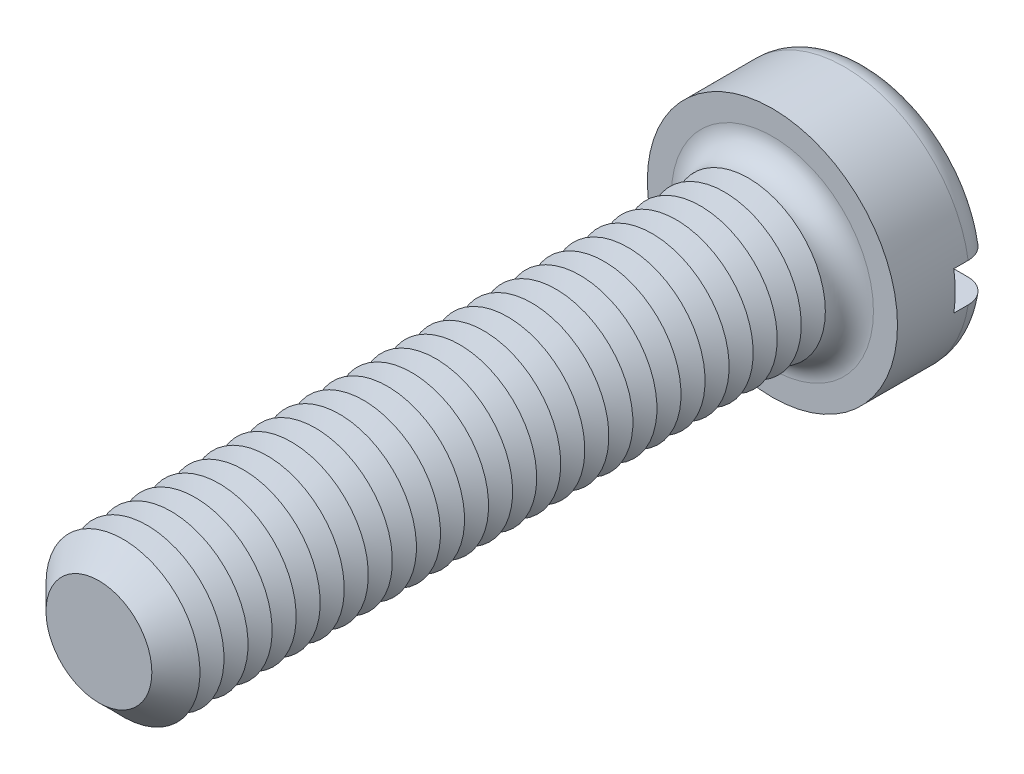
ISO-10303-21;
HEADER;
FILE_DESCRIPTION(('STEP AP214'),'2;1');
FILE_NAME('part.step','',(''),(''),'','','');
FILE_SCHEMA(('AUTOMOTIVE_DESIGN { 1 0 10303 214 1 1 1 1 }'));
ENDSEC;
DATA;
#1=APPLICATION_CONTEXT('core data for automotive mechanical design processes');
#2=APPLICATION_PROTOCOL_DEFINITION('international standard','automotive_design',2000,#1);
#3=PRODUCT_CONTEXT('',#1,'mechanical');
#4=PRODUCT('Part','Part','',(#3));
#5=PRODUCT_RELATED_PRODUCT_CATEGORY('part','',(#4));
#6=PRODUCT_DEFINITION_FORMATION('','',#4);
#7=PRODUCT_DEFINITION_CONTEXT('part definition',#1,'design');
#8=PRODUCT_DEFINITION('design','',#6,#7);
#9=PRODUCT_DEFINITION_SHAPE('','',#8);
#10=(LENGTH_UNIT() NAMED_UNIT(*) SI_UNIT(.MILLI.,.METRE.));
#11=(NAMED_UNIT(*) PLANE_ANGLE_UNIT() SI_UNIT($,.RADIAN.));
#12=(NAMED_UNIT(*) SI_UNIT($,.STERADIAN.) SOLID_ANGLE_UNIT());
#13=UNCERTAINTY_MEASURE_WITH_UNIT(LENGTH_MEASURE(1.E-05),#10,'distance_accuracy_value','');
#14=(GEOMETRIC_REPRESENTATION_CONTEXT(3) GLOBAL_UNCERTAINTY_ASSIGNED_CONTEXT((#13)) GLOBAL_UNIT_ASSIGNED_CONTEXT((#10,
#11,#12)) REPRESENTATION_CONTEXT('',''));
#15=CARTESIAN_POINT('',(0.,0.,0.));
#16=DIRECTION('',(0.,0.,1.));
#17=DIRECTION('',(1.,0.,0.));
#18=AXIS2_PLACEMENT_3D('',#15,#16,#17);
#19=CARTESIAN_POINT('',(0.,0.,-5.));
#20=DIRECTION('',(0.,0.,1.));
#21=DIRECTION('',(1.,0.,0.));
#22=AXIS2_PLACEMENT_3D('',#19,#20,#21);
#23=PLANE('',#22);
#24=CARTESIAN_POINT('',(0.,0.,-5.));
#25=DIRECTION('',(0.,0.,1.));
#26=DIRECTION('',(1.,0.,0.));
#27=AXIS2_PLACEMENT_3D('',#24,#25,#26);
#28=CIRCLE('',#27,5.25);
#29=CARTESIAN_POINT('',(-5.15388203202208,1.,-5.));
#30=VERTEX_POINT('',#29);
#31=CARTESIAN_POINT('',(5.15388203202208,1.,-5.));
#32=VERTEX_POINT('',#31);
#33=EDGE_CURVE('E116',#30,#32,#28,.F.);
#34=ORIENTED_EDGE('',*,*,#33,.T.);
#35=DIRECTION('',(1.,0.,0.));
#36=VECTOR('',#35,1.);
#37=CARTESIAN_POINT('',(-6.5,1.,-5.));
#38=LINE('',#37,#36);
#39=EDGE_CURVE('E111',#30,#32,#38,.T.);
#40=ORIENTED_EDGE('',*,*,#39,.F.);
#41=EDGE_LOOP('',(#34,#40));
#42=FACE_BOUND('',#41,.T.);
#43=ADVANCED_FACE('F39',(#42),#23,.F.);
#44=CARTESIAN_POINT('',(0.,0.,-3.75));
#45=DIRECTION('',(0.,0.,1.));
#46=DIRECTION('',(1.,0.,0.));
#47=AXIS2_PLACEMENT_3D('',#44,#45,#46);
#48=TOROIDAL_SURFACE('',#47,5.25,1.25);
#49=CARTESIAN_POINT('',(-6.04655789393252,1.,-4.63904490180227));
#50=CARTESIAN_POINT('',(-5.99546860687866,1.,-4.68885774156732));
#51=CARTESIAN_POINT('',(-5.94008472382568,1.,-4.73434760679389));
#52=CARTESIAN_POINT('',(-5.8223927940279,1.,-4.81538052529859));
#53=CARTESIAN_POINT('',(-5.7600753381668,1.,-4.85090982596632));
#54=CARTESIAN_POINT('',(-5.63044351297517,1.,-4.91100606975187));
#55=CARTESIAN_POINT('',(-5.56313479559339,1.,-4.93558519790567));
#56=CARTESIAN_POINT('',(-5.42539577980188,1.,-4.97322457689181));
#57=CARTESIAN_POINT('',(-5.35496625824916,1.,-4.98628767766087));
#58=CARTESIAN_POINT('',(-5.21212635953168,1.,-5.00070478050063));
#59=CARTESIAN_POINT('',(-5.13970265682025,1.,-5.00192674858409));
#60=CARTESIAN_POINT('',(-4.99565121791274,1.,-4.99234085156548));
#61=CARTESIAN_POINT('',(-4.92402357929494,1.,-4.98153152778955));
#62=CARTESIAN_POINT('',(-4.78274786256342,1.,-4.94801424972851));
#63=CARTESIAN_POINT('',(-4.71313137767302,1.,-4.92517296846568));
#64=CARTESIAN_POINT('',(-4.57871041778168,1.,-4.86813760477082));
#65=CARTESIAN_POINT('',(-4.51390612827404,1.,-4.83394308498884));
#66=CARTESIAN_POINT('',(-4.39095493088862,1.,-4.75508341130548));
#67=CARTESIAN_POINT('',(-4.33281197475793,1.,-4.7104120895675));
#68=CARTESIAN_POINT('',(-4.22499800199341,1.,-4.61179869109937));
#69=CARTESIAN_POINT('',(-4.17532640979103,1.,-4.55785724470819));
#70=CARTESIAN_POINT('',(-4.08677450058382,1.,-4.4431082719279));
#71=CARTESIAN_POINT('',(-4.0477350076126,1.,-4.38242369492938));
#72=CARTESIAN_POINT('',(-3.98074296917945,1.,-4.25521412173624));
#73=CARTESIAN_POINT('',(-3.95278836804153,1.,-4.18869021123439));
#74=CARTESIAN_POINT('',(-3.90959497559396,1.,-4.0537026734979));
#75=CARTESIAN_POINT('',(-3.89401985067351,1.,-3.98534663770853));
#76=CARTESIAN_POINT('',(-3.8748586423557,1.,-3.84697740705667));
#77=CARTESIAN_POINT('',(-3.87127067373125,1.,-3.7769644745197));
#78=CARTESIAN_POINT('',(-3.8761573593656,1.,-3.63892215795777));
#79=CARTESIAN_POINT('',(-3.88436651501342,1.,-3.57088319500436));
#80=CARTESIAN_POINT('',(-3.91207743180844,1.,-3.43714958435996));
#81=CARTESIAN_POINT('',(-3.93157911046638,1.,-3.37145491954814));
#82=CARTESIAN_POINT('',(-3.98125045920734,1.,-3.24411474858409));
#83=CARTESIAN_POINT('',(-4.01143761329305,1.,-3.18247607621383));
#84=CARTESIAN_POINT('',(-4.08150210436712,1.,-3.064981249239));
#85=CARTESIAN_POINT('',(-4.12138048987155,1.,-3.0091257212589));
#86=CARTESIAN_POINT('',(-4.2106718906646,1.,-2.90336353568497));
#87=CARTESIAN_POINT('',(-4.26028693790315,1.,-2.85362751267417));
#88=CARTESIAN_POINT('',(-4.36696587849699,1.,-2.76291710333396));
#89=CARTESIAN_POINT('',(-4.42403082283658,1.,-2.72194395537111));
#90=CARTESIAN_POINT('',(-4.54567957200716,1.,-2.64877280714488));
#91=CARTESIAN_POINT('',(-4.61042643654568,1.,-2.61684571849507));
#92=CARTESIAN_POINT('',(-4.74430563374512,1.,-2.56412359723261));
#93=CARTESIAN_POINT('',(-4.81343838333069,1.,-2.54332962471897));
#94=CARTESIAN_POINT('',(-4.95527237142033,1.,-2.51320471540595));
#95=CARTESIAN_POINT('',(-5.0280120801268,1.,-2.50405449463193));
#96=CARTESIAN_POINT('',(-5.17399775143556,1.,-2.49810126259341));
#97=CARTESIAN_POINT('',(-5.24724372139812,1.,-2.50129843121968));
#98=CARTESIAN_POINT('',(-5.3921014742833,1.,-2.52000776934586));
#99=CARTESIAN_POINT('',(-5.4637142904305,1.,-2.53551191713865));
#100=CARTESIAN_POINT('',(-5.60326680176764,1.,-2.57846304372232));
#101=CARTESIAN_POINT('',(-5.67120668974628,1.,-2.60590939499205));
#102=CARTESIAN_POINT('',(-5.80064060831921,1.,-2.67164926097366));
#103=CARTESIAN_POINT('',(-5.862199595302,1.,-2.7098148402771));
#104=CARTESIAN_POINT('',(-5.9779079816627,1.,-2.79608690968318));
#105=CARTESIAN_POINT('',(-6.03205795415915,1.,-2.84419263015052));
#106=CARTESIAN_POINT('',(-6.13055119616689,1.,-2.94820522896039));
#107=CARTESIAN_POINT('',(-6.17502887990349,1.,-3.00398483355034));
#108=CARTESIAN_POINT('',(-6.25384180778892,1.,-3.12230113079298));
#109=CARTESIAN_POINT('',(-6.28817779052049,1.,-3.18483733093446));
#110=CARTESIAN_POINT('',(-6.34527986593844,1.,-3.31401726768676));
#111=CARTESIAN_POINT('',(-6.36818984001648,1.,-3.38059742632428));
#112=CARTESIAN_POINT('',(-6.40240470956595,1.,-3.5166725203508));
#113=CARTESIAN_POINT('',(-6.41371067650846,1.,-3.58616718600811));
#114=CARTESIAN_POINT('',(-6.42433240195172,1.,-3.72550026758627));
#115=CARTESIAN_POINT('',(-6.4237441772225,1.,-3.79533138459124));
#116=CARTESIAN_POINT('',(-6.41082814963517,1.,-3.93391789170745));
#117=CARTESIAN_POINT('',(-6.39849757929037,1.,-4.00267302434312));
#118=CARTESIAN_POINT('',(-6.36249191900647,1.,-4.13704597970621));
#119=CARTESIAN_POINT('',(-6.33883072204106,1.,-4.20266753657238));
#120=CARTESIAN_POINT('',(-6.28088769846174,1.,-4.32897165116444));
#121=CARTESIAN_POINT('',(-6.24661890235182,1.,-4.38966015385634));
#122=CARTESIAN_POINT('',(-6.18404039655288,1.,-4.48163773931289));
#123=CARTESIAN_POINT('',(-6.15876600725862,1.,-4.51503333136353));
#124=CARTESIAN_POINT('',(-6.10500607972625,1.,-4.5791298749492));
#125=CARTESIAN_POINT('',(-6.07652056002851,1.,-4.60983084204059));
#126=CARTESIAN_POINT('',(-6.04655789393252,1.,-4.63904490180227));
#127=B_SPLINE_CURVE_WITH_KNOTS('',3,(#49,#50,#51,#52,#53,#54,#55,#56,#57,#58,#59,#60,#61,#62,
#63,#64,#65,#66,#67,#68,#69,#70,#71,#72,#73,#74,#75,#76,#77,#78,#79,#80,#81,#82,#83,#84,#85,#86,
#87,#88,#89,#90,#91,#92,#93,#94,#95,#96,#97,#98,#99,#100,#101,#102,#103,#104,#105,#106,#107,
#108,#109,#110,#111,#112,#113,#114,#115,#116,#117,#118,#119,#120,#121,#122,#123,#124,#125,#126),
.UNSPECIFIED.,.T.,.F.,(4,2,2,2,2,2,2,2,2,2,2,2,2,2,2,2,2,2,2,2,2,2,2,2,2,2,2,2,2,2,2,2,2,2,2,2,
2,2,4),(0.,0.213907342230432,0.428108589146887,0.642070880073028,0.855980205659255,
1.07227200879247,1.28859003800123,1.50735715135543,1.72613269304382,1.94503735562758,
2.16392713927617,2.37933295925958,2.59469881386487,2.80399176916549,3.01325180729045,
3.2178754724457,3.42249764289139,3.62745618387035,3.83243690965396,4.04223444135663,
4.25206160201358,4.46763253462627,4.68322399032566,4.90212226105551,5.12102372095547,
5.33978261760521,5.55853002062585,5.77477015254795,5.99099354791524,6.20398686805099,
6.41696467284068,6.62718821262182,6.83739233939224,7.0459002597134,7.25445733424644,
7.46275934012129,7.67080647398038,7.79625882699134,7.92171045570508),.UNSPECIFIED.);
#128=CARTESIAN_POINT('',(-6.42261628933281,1.,-3.74999999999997));
#129=VERTEX_POINT('',#128);
#130=EDGE_CURVE('E386',#129,#30,#127,.T.);
#131=ORIENTED_EDGE('',*,*,#130,.F.);
#132=CARTESIAN_POINT('',(0.,0.,-3.75));
#133=DIRECTION('',(0.,0.,1.));
#134=DIRECTION('',(1.,0.,0.));
#135=AXIS2_PLACEMENT_3D('',#132,#133,#134);
#136=CIRCLE('',#135,6.5);
#137=CARTESIAN_POINT('',(6.42261628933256,1.,-3.75));
#138=VERTEX_POINT('',#137);
#139=EDGE_CURVE('E124',#138,#129,#136,.T.);
#140=ORIENTED_EDGE('',*,*,#139,.F.);
#141=CARTESIAN_POINT('',(4.06944999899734,1.,-4.4133199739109));
#142=CARTESIAN_POINT('',(4.10828271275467,1.,-4.47354709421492));
#143=CARTESIAN_POINT('',(4.15233880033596,1.,-4.53047894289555));
#144=CARTESIAN_POINT('',(4.24946916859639,1.,-4.63614530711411));
#145=CARTESIAN_POINT('',(4.3025574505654,1.,-4.68486685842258));
#146=CARTESIAN_POINT('',(4.41603250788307,1.,-4.77271114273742));
#147=CARTESIAN_POINT('',(4.47640839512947,1.,-4.8118479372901));
#148=CARTESIAN_POINT('',(4.60277035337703,1.,-4.87959878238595));
#149=CARTESIAN_POINT('',(4.66875480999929,1.,-4.90821584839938));
#150=CARTESIAN_POINT('',(4.80558589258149,1.,-4.95456537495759));
#151=CARTESIAN_POINT('',(4.87649196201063,1.,-4.97212253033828));
#152=CARTESIAN_POINT('',(5.02024710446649,1.,-4.99514979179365));
#153=CARTESIAN_POINT('',(5.09309636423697,1.,-5.00061873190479));
#154=CARTESIAN_POINT('',(5.23902872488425,1.,-4.99926689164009));
#155=CARTESIAN_POINT('',(5.31211131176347,1.,-4.99238812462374));
#156=CARTESIAN_POINT('',(5.45605806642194,1.,-4.96635140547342));
#157=CARTESIAN_POINT('',(5.52692231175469,1.,-4.94719388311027));
#158=CARTESIAN_POINT('',(5.66376170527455,1.,-4.89728421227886));
#159=CARTESIAN_POINT('',(5.72977335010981,1.,-4.86663219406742));
#160=CARTESIAN_POINT('',(5.85560715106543,1.,-4.79452334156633));
#161=CARTESIAN_POINT('',(5.91542977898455,1.,-4.7530673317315));
#162=CARTESIAN_POINT('',(6.02626022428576,1.,-4.66116821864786));
#163=CARTESIAN_POINT('',(6.07738307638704,1.,-4.6108638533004));
#164=CARTESIAN_POINT('',(6.17030947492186,1.,-4.50227823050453));
#165=CARTESIAN_POINT('',(6.2121137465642,1.,-4.44399759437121));
#166=CARTESIAN_POINT('',(6.28460268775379,1.,-4.32200305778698));
#167=CARTESIAN_POINT('',(6.31543589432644,1.,-4.2583773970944));
#168=CARTESIAN_POINT('',(6.36586009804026,1.,-4.12681721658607));
#169=CARTESIAN_POINT('',(6.38545178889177,1.,-4.0588829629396));
#170=CARTESIAN_POINT('',(6.41265760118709,1.,-3.92136007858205));
#171=CARTESIAN_POINT('',(6.42038873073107,1.,-3.85179457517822));
#172=CARTESIAN_POINT('',(6.42401070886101,1.,-3.7123569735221));
#173=CARTESIAN_POINT('',(6.41990193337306,1.,-3.64248488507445));
#174=CARTESIAN_POINT('',(6.40000894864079,1.,-3.50470871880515));
#175=CARTESIAN_POINT('',(6.38427119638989,1.,-3.43679792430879));
#176=CARTESIAN_POINT('',(6.34164491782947,1.,-3.30457296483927));
#177=CARTESIAN_POINT('',(6.31475638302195,1.,-3.24025880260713));
#178=CARTESIAN_POINT('',(6.2505455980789,1.,-3.11686791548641));
#179=CARTESIAN_POINT('',(6.21319759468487,1.,-3.05780459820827));
#180=CARTESIAN_POINT('',(6.12919411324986,1.,-2.94671919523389));
#181=CARTESIAN_POINT('',(6.08253833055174,1.,-2.89469734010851));
#182=CARTESIAN_POINT('',(5.98083387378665,1.,-2.79868150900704));
#183=CARTESIAN_POINT('',(5.92571704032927,1.,-2.75475975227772));
#184=CARTESIAN_POINT('',(5.80897194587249,1.,-2.67665277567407));
#185=CARTESIAN_POINT('',(5.74734329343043,1.,-2.64246814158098));
#186=CARTESIAN_POINT('',(5.6184644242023,1.,-2.58431810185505));
#187=CARTESIAN_POINT('',(5.55115102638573,1.,-2.56049275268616));
#188=CARTESIAN_POINT('',(5.41351272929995,1.,-2.52429868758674));
#189=CARTESIAN_POINT('',(5.34318759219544,1.,-2.51193087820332));
#190=CARTESIAN_POINT('',(5.20041507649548,1.,-2.49882112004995));
#191=CARTESIAN_POINT('',(5.12795169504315,1.,-2.49825332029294));
#192=CARTESIAN_POINT('',(4.98393373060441,1.,-2.50914771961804));
#193=CARTESIAN_POINT('',(4.91237921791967,1.,-2.52061084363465));
#194=CARTESIAN_POINT('',(4.77137358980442,1.,-2.55542281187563));
#195=CARTESIAN_POINT('',(4.70195472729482,1.,-2.57890245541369));
#196=CARTESIAN_POINT('',(4.56803538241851,1.,-2.63717701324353));
#197=CARTESIAN_POINT('',(4.50353509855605,1.,-2.67197238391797));
#198=CARTESIAN_POINT('',(4.38131858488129,1.,-2.7519648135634));
#199=CARTESIAN_POINT('',(4.32360365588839,1.,-2.79716386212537));
#200=CARTESIAN_POINT('',(4.21673400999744,1.,-2.89675634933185));
#201=CARTESIAN_POINT('',(4.16757871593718,1.,-2.95114916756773));
#202=CARTESIAN_POINT('',(4.08014713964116,1.,-3.06667703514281));
#203=CARTESIAN_POINT('',(4.04170608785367,1.,-3.12768727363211));
#204=CARTESIAN_POINT('',(3.97596192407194,1.,-3.25543782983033));
#205=CARTESIAN_POINT('',(3.94865624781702,1.,-3.32217682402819));
#206=CARTESIAN_POINT('',(3.9067737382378,1.,-3.45745603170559));
#207=CARTESIAN_POINT('',(3.89185707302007,1.,-3.52589108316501));
#208=CARTESIAN_POINT('',(3.87400755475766,1.,-3.66432360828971));
#209=CARTESIAN_POINT('',(3.87107601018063,1.,-3.73432125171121));
#210=CARTESIAN_POINT('',(3.8772387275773,1.,-3.87228267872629));
#211=CARTESIAN_POINT('',(3.88607933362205,1.,-3.94025811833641));
#212=CARTESIAN_POINT('',(3.91502769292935,1.,-4.07370133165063));
#213=CARTESIAN_POINT('',(3.93512131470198,1.,-4.1391721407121));
#214=CARTESIAN_POINT('',(3.9752037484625,1.,-4.23926719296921));
#215=CARTESIAN_POINT('',(3.99171171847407,1.,-4.27532618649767));
#216=CARTESIAN_POINT('',(4.02809737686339,1.,-4.34569933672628));
#217=CARTESIAN_POINT('',(4.04797497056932,1.,-4.3800135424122));
#218=CARTESIAN_POINT('',(4.06944999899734,1.,-4.4133199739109));
#219=B_SPLINE_CURVE_WITH_KNOTS('',3,(#141,#142,#143,#144,#145,#146,#147,#148,#149,#150,#151,
#152,#153,#154,#155,#156,#157,#158,#159,#160,#161,#162,#163,#164,#165,#166,#167,#168,#169,#170,
#171,#172,#173,#174,#175,#176,#177,#178,#179,#180,#181,#182,#183,#184,#185,#186,#187,#188,#189,
#190,#191,#192,#193,#194,#195,#196,#197,#198,#199,#200,#201,#202,#203,#204,#205,#206,#207,#208,
#209,#210,#211,#212,#213,#214,#215,#216,#217,#218),.UNSPECIFIED.,.T.,.F.,(4,2,2,2,2,2,2,2,2,2,2,
2,2,2,2,2,2,2,2,2,2,2,2,2,2,2,2,2,2,2,2,2,2,2,2,2,2,2,4),(0.,0.214833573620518,
0.430003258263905,0.644855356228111,0.859645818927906,1.0777603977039,1.29589601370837,
1.51505870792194,1.73421373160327,1.95150241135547,2.16877451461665,2.38290237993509,
2.59701357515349,2.8081044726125,3.01918234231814,3.22816416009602,3.43713934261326,
3.64528416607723,3.85342914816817,4.06209119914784,4.27076008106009,4.48120788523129,
4.69166834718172,4.90489186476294,5.11813225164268,5.33451752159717,5.55091942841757,
5.76972860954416,5.98854661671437,6.20740650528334,6.42625163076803,6.64151774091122,
6.85673425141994,7.0658317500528,7.27495207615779,7.47963858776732,7.68406862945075,
7.80287790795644,7.92168384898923),.UNSPECIFIED.);
#220=EDGE_CURVE('E388',#32,#138,#219,.T.);
#221=ORIENTED_EDGE('',*,*,#220,.F.);
#222=ORIENTED_EDGE('',*,*,#33,.F.);
#223=EDGE_LOOP('',(#131,#140,#221,#222));
#224=FACE_BOUND('',#223,.T.);
#225=ADVANCED_FACE('F370',(#224),#48,.T.);
#226=CARTESIAN_POINT('',(0.,0.,-5.));
#227=DIRECTION('',(0.,0.,1.));
#228=DIRECTION('',(1.,0.,0.));
#229=AXIS2_PLACEMENT_3D('',#226,#227,#228);
#230=CYLINDRICAL_SURFACE('',#229,6.5);
#231=DIRECTION('',(0.,0.,1.));
#232=VECTOR('',#231,1.);
#233=CARTESIAN_POINT('',(6.42261628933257,1.,-5.));
#234=LINE('',#233,#232);
#235=CARTESIAN_POINT('',(6.42261628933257,1.,-3.));
#236=VERTEX_POINT('',#235);
#237=EDGE_CURVE('E404',#138,#236,#234,.T.);
#238=ORIENTED_EDGE('',*,*,#237,.F.);
#239=ORIENTED_EDGE('',*,*,#139,.T.);
#240=DIRECTION('',(0.,0.,1.));
#241=VECTOR('',#240,1.);
#242=CARTESIAN_POINT('',(-6.42261628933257,1.,-5.));
#243=LINE('',#242,#241);
#244=CARTESIAN_POINT('',(-6.42261628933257,1.,-3.));
#245=VERTEX_POINT('',#244);
#246=EDGE_CURVE('E63',#245,#129,#243,.F.);
#247=ORIENTED_EDGE('',*,*,#246,.F.);
#248=CARTESIAN_POINT('',(0.,0.,-3.));
#249=DIRECTION('',(0.,0.,-1.));
#250=DIRECTION('',(-1.,0.,0.));
#251=AXIS2_PLACEMENT_3D('',#248,#249,#250);
#252=CIRCLE('',#251,6.5);
#253=CARTESIAN_POINT('',(-6.42261628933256,-0.999999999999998,-3.));
#254=VERTEX_POINT('',#253);
#255=EDGE_CURVE('E43',#245,#254,#252,.F.);
#256=ORIENTED_EDGE('',*,*,#255,.T.);
#257=DIRECTION('',(0.,0.,1.));
#258=VECTOR('',#257,1.);
#259=CARTESIAN_POINT('',(-6.42261628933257,-0.999999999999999,-5.));
#260=LINE('',#259,#258);
#261=CARTESIAN_POINT('',(-6.42261628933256,-0.999999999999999,-3.75));
#262=VERTEX_POINT('',#261);
#263=EDGE_CURVE('E401',#262,#254,#260,.T.);
#264=ORIENTED_EDGE('',*,*,#263,.F.);
#265=CARTESIAN_POINT('',(6.42261628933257,-1.,-3.75));
#266=VERTEX_POINT('',#265);
#267=EDGE_CURVE('E126',#262,#266,#136,.T.);
#268=ORIENTED_EDGE('',*,*,#267,.T.);
#269=DIRECTION('',(0.,0.,1.));
#270=VECTOR('',#269,1.);
#271=CARTESIAN_POINT('',(6.42261628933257,-1.,-5.));
#272=LINE('',#271,#270);
#273=CARTESIAN_POINT('',(6.42261628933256,-1.,-3.));
#274=VERTEX_POINT('',#273);
#275=EDGE_CURVE('E55',#274,#266,#272,.F.);
#276=ORIENTED_EDGE('',*,*,#275,.F.);
#277=EDGE_CURVE('E11',#274,#236,#252,.F.);
#278=ORIENTED_EDGE('',*,*,#277,.T.);
#279=EDGE_LOOP('',(#238,#239,#247,#256,#264,#268,#276,#278));
#280=FACE_BOUND('',#279,.T.);
#281=CARTESIAN_POINT('',(0.,0.,0.));
#282=DIRECTION('',(0.,0.,1.));
#283=DIRECTION('',(1.,0.,0.));
#284=AXIS2_PLACEMENT_3D('',#281,#282,#283);
#285=CIRCLE('',#284,6.5);
#286=CARTESIAN_POINT('',(6.5,0.,0.));
#287=VERTEX_POINT('',#286);
#288=EDGE_CURVE('E407',#287,#287,#285,.T.);
#289=ORIENTED_EDGE('',*,*,#288,.F.);
#290=EDGE_LOOP('',(#289));
#291=FACE_BOUND('',#290,.T.);
#292=ADVANCED_FACE('F366',(#280,#291),#230,.T.);
#293=CARTESIAN_POINT('',(5.15388203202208,-1.,-5.));
#294=VERTEX_POINT('',#293);
#295=CARTESIAN_POINT('',(-5.15388203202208,-0.999999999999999,-5.));
#296=VERTEX_POINT('',#295);
#297=EDGE_CURVE('E109',#294,#296,#28,.F.);
#298=ORIENTED_EDGE('',*,*,#297,.T.);
#299=DIRECTION('',(-1.,0.,0.));
#300=VECTOR('',#299,1.);
#301=CARTESIAN_POINT('',(-6.5,-0.999999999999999,-5.));
#302=LINE('',#301,#300);
#303=EDGE_CURVE('E96',#294,#296,#302,.T.);
#304=ORIENTED_EDGE('',*,*,#303,.F.);
#305=EDGE_LOOP('',(#298,#304));
#306=FACE_BOUND('',#305,.T.);
#307=ADVANCED_FACE('F108',(#306),#23,.F.);
#308=CARTESIAN_POINT('',(0.,0.,0.));
#309=DIRECTION('',(0.,0.,1.));
#310=DIRECTION('',(1.,0.,0.));
#311=AXIS2_PLACEMENT_3D('',#308,#309,#310);
#312=PLANE('',#311);
#313=CARTESIAN_POINT('',(0.,0.,0.));
#314=DIRECTION('',(0.,0.,1.));
#315=DIRECTION('',(1.,0.,0.));
#316=AXIS2_PLACEMENT_3D('',#313,#314,#315);
#317=CIRCLE('',#316,5.25);
#318=CARTESIAN_POINT('',(5.25,0.,0.));
#319=VERTEX_POINT('',#318);
#320=EDGE_CURVE('E115',#319,#319,#317,.F.);
#321=ORIENTED_EDGE('',*,*,#320,.T.);
#322=EDGE_LOOP('',(#321));
#323=FACE_BOUND('',#322,.T.);
#324=ORIENTED_EDGE('',*,*,#288,.T.);
#325=EDGE_LOOP('',(#324));
#326=FACE_BOUND('',#325,.T.);
#327=ADVANCED_FACE('F365',(#323,#326),#312,.T.);
#328=CARTESIAN_POINT('',(-6.04655789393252,-0.999999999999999,-4.63904490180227));
#329=CARTESIAN_POINT('',(-6.0966604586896,-0.999999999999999,-4.59018532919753));
#330=CARTESIAN_POINT('',(-6.14270501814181,-0.999999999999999,-4.53709744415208));
#331=CARTESIAN_POINT('',(-6.22528519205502,-0.999999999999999,-4.42391631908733));
#332=CARTESIAN_POINT('',(-6.26181074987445,-0.999999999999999,-4.36381576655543));
#333=CARTESIAN_POINT('',(-6.32422109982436,-0.999999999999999,-4.23831836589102));
#334=CARTESIAN_POINT('',(-6.35010658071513,-0.999999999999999,-4.17292186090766));
#335=CARTESIAN_POINT('',(-6.39044668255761,-0.999999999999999,-4.03870925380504));
#336=CARTESIAN_POINT('',(-6.40490396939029,-0.999999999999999,-3.96989395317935));
#337=CARTESIAN_POINT('',(-6.42190814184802,-0.999999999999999,-3.83122595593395));
#338=CARTESIAN_POINT('',(-6.4245257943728,-0.999999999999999,-3.76138193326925));
#339=CARTESIAN_POINT('',(-6.41796432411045,-0.999999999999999,-3.62224935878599));
#340=CARTESIAN_POINT('',(-6.40878509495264,-0.999999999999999,-3.55296081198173));
#341=CARTESIAN_POINT('',(-6.37894560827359,-0.999999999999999,-3.41709241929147));
#342=CARTESIAN_POINT('',(-6.35831520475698,-0.999999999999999,-3.35050601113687));
#343=CARTESIAN_POINT('',(-6.30620980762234,-0.999999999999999,-3.22172312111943));
#344=CARTESIAN_POINT('',(-6.2747347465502,-0.999999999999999,-3.15952666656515));
#345=CARTESIAN_POINT('',(-6.20172710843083,-0.999999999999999,-3.04101762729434));
#346=CARTESIAN_POINT('',(-6.16015622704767,-0.999999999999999,-2.98472864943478));
#347=CARTESIAN_POINT('',(-6.06823774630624,-0.999999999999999,-2.87984578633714));
#348=CARTESIAN_POINT('',(-6.01788981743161,-0.999999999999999,-2.83125219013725));
#349=CARTESIAN_POINT('',(-5.90933830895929,-0.999999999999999,-2.74262118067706));
#350=CARTESIAN_POINT('',(-5.85106338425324,-0.999999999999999,-2.70267117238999));
#351=CARTESIAN_POINT('',(-5.72870702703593,-0.999999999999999,-2.63296796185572));
#352=CARTESIAN_POINT('',(-5.66462521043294,-0.999999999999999,-2.6032154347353));
#353=CARTESIAN_POINT('',(-5.53153273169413,-0.999999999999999,-2.55430842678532));
#354=CARTESIAN_POINT('',(-5.46246626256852,-0.999999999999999,-2.53530583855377));
#355=CARTESIAN_POINT('',(-5.32214267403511,-0.999999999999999,-2.5089831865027));
#356=CARTESIAN_POINT('',(-5.25088537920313,-0.999999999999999,-2.50166406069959));
#357=CARTESIAN_POINT('',(-5.10710123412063,-0.999999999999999,-2.49882202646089));
#358=CARTESIAN_POINT('',(-5.03457095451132,-0.999999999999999,-2.50347166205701));
#359=CARTESIAN_POINT('',(-4.8912897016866,-0.999999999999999,-2.52476029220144));
#360=CARTESIAN_POINT('',(-4.82053886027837,-0.999999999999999,-2.54140017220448));
#361=CARTESIAN_POINT('',(-4.68213257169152,-0.999999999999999,-2.58641614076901));
#362=CARTESIAN_POINT('',(-4.61451256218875,-0.999999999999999,-2.61490131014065));
#363=CARTESIAN_POINT('',(-4.48502801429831,-0.999999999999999,-2.68285095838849));
#364=CARTESIAN_POINT('',(-4.42316359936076,-0.999999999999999,-2.72231567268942));
#365=CARTESIAN_POINT('',(-4.30720694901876,-0.999999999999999,-2.81103994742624));
#366=CARTESIAN_POINT('',(-4.25309118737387,-0.999999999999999,-2.86026872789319));
#367=CARTESIAN_POINT('',(-4.15409408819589,-0.999999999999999,-2.9672764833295));
#368=CARTESIAN_POINT('',(-4.10921182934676,-0.999999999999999,-3.02505460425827));
#369=CARTESIAN_POINT('',(-4.03096584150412,-0.999999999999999,-3.14632492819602));
#370=CARTESIAN_POINT('',(-3.99739097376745,-0.999999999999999,-3.2096807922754));
#371=CARTESIAN_POINT('',(-3.94171839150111,-0.999999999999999,-3.34124912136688));
#372=CARTESIAN_POINT('',(-3.91961840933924,-0.999999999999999,-3.40946062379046));
#373=CARTESIAN_POINT('',(-3.88816636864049,-0.999999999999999,-3.54669256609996));
#374=CARTESIAN_POINT('',(-3.87846562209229,-0.999999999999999,-3.61563318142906));
#375=CARTESIAN_POINT('',(-3.87100568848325,-0.999999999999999,-3.75415397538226));
#376=CARTESIAN_POINT('',(-3.87324501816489,-0.999999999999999,-3.82373407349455));
#377=CARTESIAN_POINT('',(-3.88943589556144,-0.999999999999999,-3.96027701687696));
#378=CARTESIAN_POINT('',(-3.90318225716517,-0.999999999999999,-4.0272643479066));
#379=CARTESIAN_POINT('',(-3.94163954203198,-0.999999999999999,-4.1580093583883));
#380=CARTESIAN_POINT('',(-3.96635075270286,-0.999999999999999,-4.22176695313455));
#381=CARTESIAN_POINT('',(-4.026160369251,-0.999999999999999,-4.34483320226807));
#382=CARTESIAN_POINT('',(-4.06134035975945,-0.999999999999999,-4.40410214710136));
#383=CARTESIAN_POINT('',(-4.14090865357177,-0.999999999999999,-4.51609417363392));
#384=CARTESIAN_POINT('',(-4.18529811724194,-0.999999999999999,-4.56881642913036));
#385=CARTESIAN_POINT('',(-4.2832649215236,-0.999999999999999,-4.66770177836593));
#386=CARTESIAN_POINT('',(-4.33705327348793,-0.999999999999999,-4.71365579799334));
#387=CARTESIAN_POINT('',(-4.45141776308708,-0.999999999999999,-4.79615385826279));
#388=CARTESIAN_POINT('',(-4.51199483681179,-0.999999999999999,-4.83269659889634));
#389=CARTESIAN_POINT('',(-4.63989216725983,-0.999999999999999,-4.89626962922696));
#390=CARTESIAN_POINT('',(-4.70734508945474,-0.999999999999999,-4.92303326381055));
#391=CARTESIAN_POINT('',(-4.84575497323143,-0.999999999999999,-4.96500199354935));
#392=CARTESIAN_POINT('',(-4.91671207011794,-0.999999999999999,-4.98020664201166));
#393=CARTESIAN_POINT('',(-5.06097761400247,-0.999999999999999,-4.9987306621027));
#394=CARTESIAN_POINT('',(-5.13430353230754,-0.999999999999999,-5.00191441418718));
#395=CARTESIAN_POINT('',(-5.28046546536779,-0.999999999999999,-4.99587686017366));
#396=CARTESIAN_POINT('',(-5.35330135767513,-0.999999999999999,-4.98665256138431));
#397=CARTESIAN_POINT('',(-5.49610354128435,-0.999999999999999,-4.95604184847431));
#398=CARTESIAN_POINT('',(-5.56607890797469,-0.999999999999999,-4.93469772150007));
#399=CARTESIAN_POINT('',(-5.70131538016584,-0.999999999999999,-4.88041956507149));
#400=CARTESIAN_POINT('',(-5.76658233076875,-0.999999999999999,-4.84750021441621));
#401=CARTESIAN_POINT('',(-5.86782577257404,-0.999999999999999,-4.78498748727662));
#402=CARTESIAN_POINT('',(-5.90579749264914,-0.999999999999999,-4.75856648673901));
#403=CARTESIAN_POINT('',(-5.97862186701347,-0.999999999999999,-4.70172646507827));
#404=CARTESIAN_POINT('',(-6.0134745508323,-0.999999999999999,-4.6713074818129));
#405=CARTESIAN_POINT('',(-6.04655789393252,-0.999999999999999,-4.63904490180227));
#406=B_SPLINE_CURVE_WITH_KNOTS('',3,(#328,#329,#330,#331,#332,#333,#334,#335,#336,#337,#338,
#339,#340,#341,#342,#343,#344,#345,#346,#347,#348,#349,#350,#351,#352,#353,#354,#355,#356,#357,
#358,#359,#360,#361,#362,#363,#364,#365,#366,#367,#368,#369,#370,#371,#372,#373,#374,#375,#376,
#377,#378,#379,#380,#381,#382,#383,#384,#385,#386,#387,#388,#389,#390,#391,#392,#393,#394,#395,
#396,#397,#398,#399,#400,#401,#402,#403,#404,#405),.UNSPECIFIED.,.T.,.F.,(4,2,2,2,2,2,2,2,2,2,2,
2,2,2,2,2,2,2,2,2,2,2,2,2,2,2,2,2,2,2,2,2,2,2,2,2,2,2,4),(0.,0.209780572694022,
0.419781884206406,0.629769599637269,0.839708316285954,1.04839053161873,1.2570746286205,
1.46521720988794,1.67336108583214,1.88230736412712,2.09126148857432,2.30223890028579,
2.51323027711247,2.72713284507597,2.94105258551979,3.15807345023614,3.37511034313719,
3.59419176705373,3.81327788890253,4.03168404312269,4.25006839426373,4.46411376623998,
4.67811682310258,4.88595885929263,5.09377507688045,5.29796268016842,5.50215563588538,
5.70798353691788,5.91383738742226,6.12510741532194,6.33640661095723,6.55309998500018,
6.76980173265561,6.98894112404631,7.20813337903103,7.42656551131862,7.64472163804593,
7.78324365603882,7.92176436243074),.UNSPECIFIED.);
#407=EDGE_CURVE('E103',#296,#262,#406,.T.);
#408=ORIENTED_EDGE('',*,*,#407,.F.);
#409=ORIENTED_EDGE('',*,*,#297,.F.);
#410=CARTESIAN_POINT('',(4.06944999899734,-1.,-4.4133199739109));
#411=CARTESIAN_POINT('',(4.03213207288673,-1.,-4.3554312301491));
#412=CARTESIAN_POINT('',(3.9995849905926,-1.,-4.29441722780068));
#413=CARTESIAN_POINT('',(3.94511822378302,-1.,-4.16776604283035));
#414=CARTESIAN_POINT('',(3.92320762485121,-1.,-4.10212496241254));
#415=CARTESIAN_POINT('',(3.89078811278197,-1.,-3.96804412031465));
#416=CARTESIAN_POINT('',(3.88028409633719,-1.,-3.89960316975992));
#417=CARTESIAN_POINT('',(3.87107895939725,-1.,-3.76194650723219));
#418=CARTESIAN_POINT('',(3.87237511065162,-1.,-3.69273097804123));
#419=CARTESIAN_POINT('',(3.88662927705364,-1.,-3.55634460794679));
#420=CARTESIAN_POINT('',(3.89944923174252,-1.,-3.48915926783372));
#421=CARTESIAN_POINT('',(3.93611188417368,-1.,-3.35786953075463));
#422=CARTESIAN_POINT('',(3.95995518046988,-1.,-3.29376530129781));
#423=CARTESIAN_POINT('',(4.0180748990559,-1.,-3.16993562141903));
#424=CARTESIAN_POINT('',(4.05242297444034,-1.,-3.11024385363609));
#425=CARTESIAN_POINT('',(4.13041121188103,-1.,-2.9972793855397));
#426=CARTESIAN_POINT('',(4.17405248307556,-1.,-2.94400745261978));
#427=CARTESIAN_POINT('',(4.27058636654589,-1.,-2.8439150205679));
#428=CARTESIAN_POINT('',(4.32368948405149,-1.,-2.79729757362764));
#429=CARTESIAN_POINT('',(4.43679856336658,-1.,-2.71336600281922));
#430=CARTESIAN_POINT('',(4.49680546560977,-1.,-2.67605314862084));
#431=CARTESIAN_POINT('',(4.62370121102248,-1.,-2.61081752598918));
#432=CARTESIAN_POINT('',(4.69072799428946,-1.,-2.58316284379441));
#433=CARTESIAN_POINT('',(4.82843981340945,-1.,-2.5393441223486));
#434=CARTESIAN_POINT('',(4.899125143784,-1.,-2.52318100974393));
#435=CARTESIAN_POINT('',(5.04306377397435,-1.,-2.50267755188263));
#436=CARTESIAN_POINT('',(5.11633773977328,-1.,-2.49848181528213));
#437=CARTESIAN_POINT('',(5.26254809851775,-1.,-2.50249357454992));
#438=CARTESIAN_POINT('',(5.33548449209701,-1.,-2.51070104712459));
#439=CARTESIAN_POINT('',(5.4786703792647,-1.,-2.53930888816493));
#440=CARTESIAN_POINT('',(5.54892819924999,-1.,-2.5596675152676));
#441=CARTESIAN_POINT('',(5.68495799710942,-1.,-2.61204238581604));
#442=CARTESIAN_POINT('',(5.75073024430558,-1.,-2.64405792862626));
#443=CARTESIAN_POINT('',(5.8750178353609,-1.,-2.7184150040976));
#444=CARTESIAN_POINT('',(5.93361487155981,-1.,-2.76061995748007));
#445=CARTESIAN_POINT('',(6.04275377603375,-1.,-2.85440601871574));
#446=CARTESIAN_POINT('',(6.09329629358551,-1.,-2.90598637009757));
#447=CARTESIAN_POINT('',(6.18409572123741,-1.,-3.01622977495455));
#448=CARTESIAN_POINT('',(6.2244945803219,-1.,-3.07477592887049));
#449=CARTESIAN_POINT('',(6.29474798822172,-1.,-3.19788594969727));
#450=CARTESIAN_POINT('',(6.3246032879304,-1.,-3.26244938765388));
#451=CARTESIAN_POINT('',(6.37256001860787,-1.,-3.39491634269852));
#452=CARTESIAN_POINT('',(6.39079949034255,-1.,-3.46276990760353));
#453=CARTESIAN_POINT('',(6.41554133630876,-1.,-3.60058363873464));
#454=CARTESIAN_POINT('',(6.42204424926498,-1.,-3.67054370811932));
#455=CARTESIAN_POINT('',(6.42311237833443,-1.,-3.81007982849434));
#456=CARTESIAN_POINT('',(6.41775799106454,-1.,-3.879655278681));
#457=CARTESIAN_POINT('',(6.39543799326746,-1.,-4.01691664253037));
#458=CARTESIAN_POINT('',(6.3784725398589,-1.,-4.08460258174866));
#459=CARTESIAN_POINT('',(6.33344768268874,-1.,-4.21614537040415));
#460=CARTESIAN_POINT('',(6.30539273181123,-1.,-4.28000374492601));
#461=CARTESIAN_POINT('',(6.23902076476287,-1.,-4.40214140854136));
#462=CARTESIAN_POINT('',(6.20070356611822,-1.,-4.46042059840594));
#463=CARTESIAN_POINT('',(6.11467174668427,-1.,-4.5701315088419));
#464=CARTESIAN_POINT('',(6.06690270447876,-1.,-4.62152053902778));
#465=CARTESIAN_POINT('',(5.96350111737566,-1.,-4.715657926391));
#466=CARTESIAN_POINT('',(5.90786817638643,-1.,-4.75840584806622));
#467=CARTESIAN_POINT('',(5.78965380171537,-1.,-4.8345781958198));
#468=CARTESIAN_POINT('',(5.72700078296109,-1.,-4.86789149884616));
#469=CARTESIAN_POINT('',(5.59704977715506,-1.,-4.92369754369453));
#470=CARTESIAN_POINT('',(5.52975144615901,-1.,-4.94618948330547));
#471=CARTESIAN_POINT('',(5.39137621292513,-1.,-4.98006173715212));
#472=CARTESIAN_POINT('',(5.32025859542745,-1.,-4.99127571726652));
#473=CARTESIAN_POINT('',(5.17715081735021,-1.,-5.00177798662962));
#474=CARTESIAN_POINT('',(5.10516061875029,-1.,-5.00106575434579));
#475=CARTESIAN_POINT('',(4.96131924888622,-1.,-4.98769775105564));
#476=CARTESIAN_POINT('',(4.88948297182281,-1.,-4.97488146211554));
#477=CARTESIAN_POINT('',(4.74893184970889,-1.,-4.93744335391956));
#478=CARTESIAN_POINT('',(4.68021795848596,-1.,-4.91281795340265));
#479=CARTESIAN_POINT('',(4.54744428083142,-1.,-4.8522329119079));
#480=CARTESIAN_POINT('',(4.48341761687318,-1.,-4.81620070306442));
#481=CARTESIAN_POINT('',(4.36244497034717,-1.,-4.73383277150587));
#482=CARTESIAN_POINT('',(4.30549069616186,-1.,-4.68750929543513));
#483=CARTESIAN_POINT('',(4.21823158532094,-1.,-4.60311228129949));
#484=CARTESIAN_POINT('',(4.18544074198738,-1.,-4.56757118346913));
#485=CARTESIAN_POINT('',(4.12413461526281,-1.,-4.49297229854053));
#486=CARTESIAN_POINT('',(4.09561926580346,-1.,-4.45391456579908));
#487=CARTESIAN_POINT('',(4.06944999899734,-1.,-4.4133199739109));
#488=B_SPLINE_CURVE_WITH_KNOTS('',3,(#410,#411,#412,#413,#414,#415,#416,#417,#418,#419,#420,
#421,#422,#423,#424,#425,#426,#427,#428,#429,#430,#431,#432,#433,#434,#435,#436,#437,#438,#439,
#440,#441,#442,#443,#444,#445,#446,#447,#448,#449,#450,#451,#452,#453,#454,#455,#456,#457,#458,
#459,#460,#461,#462,#463,#464,#465,#466,#467,#468,#469,#470,#471,#472,#473,#474,#475,#476,#477,
#478,#479,#480,#481,#482,#483,#484,#485,#486,#487),.UNSPECIFIED.,.T.,.F.,(4,2,2,2,2,2,2,2,2,2,2,
2,2,2,2,2,2,2,2,2,2,2,2,2,2,2,2,2,2,2,2,2,2,2,2,2,2,2,4),(0.,0.206453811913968,0.4130836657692,
0.619802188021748,0.826472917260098,1.03070015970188,1.23493849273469,1.44060223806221,
1.64629054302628,1.85731119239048,2.06836062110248,2.28487349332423,2.5014038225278,
2.72053974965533,2.9396752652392,3.15806230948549,3.37643622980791,3.59203140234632,
3.80760918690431,4.01997696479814,4.23232961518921,4.44210913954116,4.65187903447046,
4.86023097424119,5.06858009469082,5.27684563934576,5.48511488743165,5.69462015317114,
5.90413597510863,6.11602561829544,6.32793096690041,6.54291770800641,6.75791385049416,
6.97580180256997,7.19375587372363,7.41312537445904,7.63223520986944,7.77701357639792,
7.92178970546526),.UNSPECIFIED.);
#489=EDGE_CURVE('E92',#266,#294,#488,.T.);
#490=ORIENTED_EDGE('',*,*,#489,.F.);
#491=ORIENTED_EDGE('',*,*,#267,.F.);
#492=EDGE_LOOP('',(#408,#409,#490,#491));
#493=FACE_BOUND('',#492,.T.);
#494=ADVANCED_FACE('F113',(#493),#48,.T.);
#495=CARTESIAN_POINT('',(0.,0.,1.25));
#496=DIRECTION('',(0.,0.,1.));
#497=DIRECTION('',(1.,0.,0.));
#498=AXIS2_PLACEMENT_3D('',#495,#496,#497);
#499=TOROIDAL_SURFACE('',#498,5.25,1.25);
#500=ORIENTED_EDGE('',*,*,#320,.F.);
#501=EDGE_LOOP('',(#500));
#502=FACE_BOUND('',#501,.T.);
#503=CARTESIAN_POINT('',(0.,0.,1.25));
#504=DIRECTION('',(0.,0.,-1.));
#505=DIRECTION('',(-1.,0.,0.));
#506=AXIS2_PLACEMENT_3D('',#503,#504,#505);
#507=CIRCLE('',#506,4.);
#508=CARTESIAN_POINT('',(-4.,0.,1.25));
#509=VERTEX_POINT('',#508);
#510=EDGE_CURVE('E412',#509,#509,#507,.T.);
#511=ORIENTED_EDGE('',*,*,#510,.T.);
#512=EDGE_LOOP('',(#511));
#513=FACE_BOUND('',#512,.T.);
#514=ADVANCED_FACE('F358',(#502,#513),#499,.F.);
#515=CARTESIAN_POINT('',(0.,0.,1.875));
#516=DIRECTION('',(0.,0.,-1.));
#517=DIRECTION('',(-1.,0.,0.));
#518=AXIS2_PLACEMENT_3D('',#515,#516,#517);
#519=CONICAL_SURFACE('',#518,2.91746824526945,1.0471975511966);
#520=ORIENTED_EDGE('',*,*,#510,.F.);
#521=EDGE_LOOP('',(#520));
#522=FACE_BOUND('',#521,.T.);
#523=CARTESIAN_POINT('',(0.,0.,1.875));
#524=DIRECTION('',(0.,0.,-1.));
#525=DIRECTION('',(-1.,0.,0.));
#526=AXIS2_PLACEMENT_3D('',#523,#524,#525);
#527=CIRCLE('',#526,2.91746824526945);
#528=CARTESIAN_POINT('',(-2.91746824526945,0.,1.875));
#529=VERTEX_POINT('',#528);
#530=EDGE_CURVE('E418',#529,#529,#527,.T.);
#531=ORIENTED_EDGE('',*,*,#530,.T.);
#532=EDGE_LOOP('',(#531));
#533=FACE_BOUND('',#532,.T.);
#534=ADVANCED_FACE('F354',(#522,#533),#519,.T.);
#535=CARTESIAN_POINT('',(0.,0.,2.5));
#536=DIRECTION('',(0.,0.,1.));
#537=DIRECTION('',(1.,0.,0.));
#538=AXIS2_PLACEMENT_3D('',#535,#536,#537);
#539=CONICAL_SURFACE('',#538,4.,1.0471975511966);
#540=ORIENTED_EDGE('',*,*,#530,.F.);
#541=EDGE_LOOP('',(#540));
#542=FACE_BOUND('',#541,.T.);
#543=CARTESIAN_POINT('',(0.,0.,2.5));
#544=DIRECTION('',(0.,0.,-1.));
#545=DIRECTION('',(-1.,0.,0.));
#546=AXIS2_PLACEMENT_3D('',#543,#544,#545);
#547=CIRCLE('',#546,4.);
#548=CARTESIAN_POINT('',(-4.,0.,2.5));
#549=VERTEX_POINT('',#548);
#550=EDGE_CURVE('E423',#549,#549,#547,.T.);
#551=ORIENTED_EDGE('',*,*,#550,.T.);
#552=EDGE_LOOP('',(#551));
#553=FACE_BOUND('',#552,.T.);
#554=ADVANCED_FACE('F350',(#542,#553),#539,.T.);
#555=CARTESIAN_POINT('',(0.,0.,3.125));
#556=DIRECTION('',(0.,0.,-1.));
#557=DIRECTION('',(-1.,0.,0.));
#558=AXIS2_PLACEMENT_3D('',#555,#556,#557);
#559=CONICAL_SURFACE('',#558,2.91746824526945,1.0471975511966);
#560=ORIENTED_EDGE('',*,*,#550,.F.);
#561=EDGE_LOOP('',(#560));
#562=FACE_BOUND('',#561,.T.);
#563=CARTESIAN_POINT('',(0.,0.,3.125));
#564=DIRECTION('',(0.,0.,-1.));
#565=DIRECTION('',(-1.,0.,0.));
#566=AXIS2_PLACEMENT_3D('',#563,#564,#565);
#567=CIRCLE('',#566,2.91746824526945);
#568=CARTESIAN_POINT('',(-2.91746824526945,0.,3.125));
#569=VERTEX_POINT('',#568);
#570=EDGE_CURVE('E426',#569,#569,#567,.T.);
#571=ORIENTED_EDGE('',*,*,#570,.T.);
#572=EDGE_LOOP('',(#571));
#573=FACE_BOUND('',#572,.T.);
#574=ADVANCED_FACE('F346',(#562,#573),#559,.T.);
#575=CARTESIAN_POINT('',(0.,0.,3.75));
#576=DIRECTION('',(0.,0.,1.));
#577=DIRECTION('',(1.,0.,0.));
#578=AXIS2_PLACEMENT_3D('',#575,#576,#577);
#579=CONICAL_SURFACE('',#578,4.,1.0471975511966);
#580=ORIENTED_EDGE('',*,*,#570,.F.);
#581=EDGE_LOOP('',(#580));
#582=FACE_BOUND('',#581,.T.);
#583=CARTESIAN_POINT('',(0.,0.,3.75));
#584=DIRECTION('',(0.,0.,-1.));
#585=DIRECTION('',(-1.,0.,0.));
#586=AXIS2_PLACEMENT_3D('',#583,#584,#585);
#587=CIRCLE('',#586,4.);
#588=CARTESIAN_POINT('',(-4.,0.,3.75));
#589=VERTEX_POINT('',#588);
#590=EDGE_CURVE('E430',#589,#589,#587,.T.);
#591=ORIENTED_EDGE('',*,*,#590,.T.);
#592=EDGE_LOOP('',(#591));
#593=FACE_BOUND('',#592,.T.);
#594=ADVANCED_FACE('F342',(#582,#593),#579,.T.);
#595=CARTESIAN_POINT('',(0.,0.,4.375));
#596=DIRECTION('',(0.,0.,-1.));
#597=DIRECTION('',(-1.,0.,0.));
#598=AXIS2_PLACEMENT_3D('',#595,#596,#597);
#599=CONICAL_SURFACE('',#598,2.91746824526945,1.0471975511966);
#600=ORIENTED_EDGE('',*,*,#590,.F.);
#601=EDGE_LOOP('',(#600));
#602=FACE_BOUND('',#601,.T.);
#603=CARTESIAN_POINT('',(0.,0.,4.375));
#604=DIRECTION('',(0.,0.,-1.));
#605=DIRECTION('',(-1.,0.,0.));
#606=AXIS2_PLACEMENT_3D('',#603,#604,#605);
#607=CIRCLE('',#606,2.91746824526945);
#608=CARTESIAN_POINT('',(-2.91746824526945,0.,4.375));
#609=VERTEX_POINT('',#608);
#610=EDGE_CURVE('E434',#609,#609,#607,.T.);
#611=ORIENTED_EDGE('',*,*,#610,.T.);
#612=EDGE_LOOP('',(#611));
#613=FACE_BOUND('',#612,.T.);
#614=ADVANCED_FACE('F338',(#602,#613),#599,.T.);
#615=CARTESIAN_POINT('',(0.,0.,5.));
#616=DIRECTION('',(0.,0.,1.));
#617=DIRECTION('',(1.,0.,0.));
#618=AXIS2_PLACEMENT_3D('',#615,#616,#617);
#619=CONICAL_SURFACE('',#618,4.,1.0471975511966);
#620=ORIENTED_EDGE('',*,*,#610,.F.);
#621=EDGE_LOOP('',(#620));
#622=FACE_BOUND('',#621,.T.);
#623=CARTESIAN_POINT('',(0.,0.,5.));
#624=DIRECTION('',(0.,0.,-1.));
#625=DIRECTION('',(-1.,0.,0.));
#626=AXIS2_PLACEMENT_3D('',#623,#624,#625);
#627=CIRCLE('',#626,4.);
#628=CARTESIAN_POINT('',(-4.,0.,5.));
#629=VERTEX_POINT('',#628);
#630=EDGE_CURVE('E438',#629,#629,#627,.T.);
#631=ORIENTED_EDGE('',*,*,#630,.T.);
#632=EDGE_LOOP('',(#631));
#633=FACE_BOUND('',#632,.T.);
#634=ADVANCED_FACE('F334',(#622,#633),#619,.T.);
#635=CARTESIAN_POINT('',(0.,0.,5.625));
#636=DIRECTION('',(0.,0.,-1.));
#637=DIRECTION('',(-1.,0.,0.));
#638=AXIS2_PLACEMENT_3D('',#635,#636,#637);
#639=CONICAL_SURFACE('',#638,2.91746824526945,1.0471975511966);
#640=ORIENTED_EDGE('',*,*,#630,.F.);
#641=EDGE_LOOP('',(#640));
#642=FACE_BOUND('',#641,.T.);
#643=CARTESIAN_POINT('',(0.,0.,5.625));
#644=DIRECTION('',(0.,0.,-1.));
#645=DIRECTION('',(-1.,0.,0.));
#646=AXIS2_PLACEMENT_3D('',#643,#644,#645);
#647=CIRCLE('',#646,2.91746824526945);
#648=CARTESIAN_POINT('',(-2.91746824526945,0.,5.625));
#649=VERTEX_POINT('',#648);
#650=EDGE_CURVE('E442',#649,#649,#647,.T.);
#651=ORIENTED_EDGE('',*,*,#650,.T.);
#652=EDGE_LOOP('',(#651));
#653=FACE_BOUND('',#652,.T.);
#654=ADVANCED_FACE('F330',(#642,#653),#639,.T.);
#655=CARTESIAN_POINT('',(0.,0.,6.25));
#656=DIRECTION('',(0.,0.,1.));
#657=DIRECTION('',(1.,0.,0.));
#658=AXIS2_PLACEMENT_3D('',#655,#656,#657);
#659=CONICAL_SURFACE('',#658,4.,1.0471975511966);
#660=ORIENTED_EDGE('',*,*,#650,.F.);
#661=EDGE_LOOP('',(#660));
#662=FACE_BOUND('',#661,.T.);
#663=CARTESIAN_POINT('',(0.,0.,6.25));
#664=DIRECTION('',(0.,0.,-1.));
#665=DIRECTION('',(-1.,0.,0.));
#666=AXIS2_PLACEMENT_3D('',#663,#664,#665);
#667=CIRCLE('',#666,4.);
#668=CARTESIAN_POINT('',(-4.,0.,6.25));
#669=VERTEX_POINT('',#668);
#670=EDGE_CURVE('E446',#669,#669,#667,.T.);
#671=ORIENTED_EDGE('',*,*,#670,.T.);
#672=EDGE_LOOP('',(#671));
#673=FACE_BOUND('',#672,.T.);
#674=ADVANCED_FACE('F326',(#662,#673),#659,.T.);
#675=CARTESIAN_POINT('',(0.,0.,6.875));
#676=DIRECTION('',(0.,0.,-1.));
#677=DIRECTION('',(-1.,0.,0.));
#678=AXIS2_PLACEMENT_3D('',#675,#676,#677);
#679=CONICAL_SURFACE('',#678,2.91746824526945,1.0471975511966);
#680=ORIENTED_EDGE('',*,*,#670,.F.);
#681=EDGE_LOOP('',(#680));
#682=FACE_BOUND('',#681,.T.);
#683=CARTESIAN_POINT('',(0.,0.,6.875));
#684=DIRECTION('',(0.,0.,-1.));
#685=DIRECTION('',(-1.,0.,0.));
#686=AXIS2_PLACEMENT_3D('',#683,#684,#685);
#687=CIRCLE('',#686,2.91746824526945);
#688=CARTESIAN_POINT('',(-2.91746824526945,0.,6.875));
#689=VERTEX_POINT('',#688);
#690=EDGE_CURVE('E449',#689,#689,#687,.T.);
#691=ORIENTED_EDGE('',*,*,#690,.T.);
#692=EDGE_LOOP('',(#691));
#693=FACE_BOUND('',#692,.T.);
#694=ADVANCED_FACE('F322',(#682,#693),#679,.T.);
#695=CARTESIAN_POINT('',(0.,0.,7.5));
#696=DIRECTION('',(0.,0.,1.));
#697=DIRECTION('',(1.,0.,0.));
#698=AXIS2_PLACEMENT_3D('',#695,#696,#697);
#699=CONICAL_SURFACE('',#698,4.,1.0471975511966);
#700=ORIENTED_EDGE('',*,*,#690,.F.);
#701=EDGE_LOOP('',(#700));
#702=FACE_BOUND('',#701,.T.);
#703=CARTESIAN_POINT('',(0.,0.,7.5));
#704=DIRECTION('',(0.,0.,-1.));
#705=DIRECTION('',(-1.,0.,0.));
#706=AXIS2_PLACEMENT_3D('',#703,#704,#705);
#707=CIRCLE('',#706,4.);
#708=CARTESIAN_POINT('',(-4.,0.,7.5));
#709=VERTEX_POINT('',#708);
#710=EDGE_CURVE('E453',#709,#709,#707,.T.);
#711=ORIENTED_EDGE('',*,*,#710,.T.);
#712=EDGE_LOOP('',(#711));
#713=FACE_BOUND('',#712,.T.);
#714=ADVANCED_FACE('F318',(#702,#713),#699,.T.);
#715=CARTESIAN_POINT('',(0.,0.,8.125));
#716=DIRECTION('',(0.,0.,-1.));
#717=DIRECTION('',(-1.,0.,0.));
#718=AXIS2_PLACEMENT_3D('',#715,#716,#717);
#719=CONICAL_SURFACE('',#718,2.91746824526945,1.0471975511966);
#720=ORIENTED_EDGE('',*,*,#710,.F.);
#721=EDGE_LOOP('',(#720));
#722=FACE_BOUND('',#721,.T.);
#723=CARTESIAN_POINT('',(0.,0.,8.125));
#724=DIRECTION('',(0.,0.,-1.));
#725=DIRECTION('',(-1.,0.,0.));
#726=AXIS2_PLACEMENT_3D('',#723,#724,#725);
#727=CIRCLE('',#726,2.91746824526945);
#728=CARTESIAN_POINT('',(-2.91746824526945,0.,8.125));
#729=VERTEX_POINT('',#728);
#730=EDGE_CURVE('E456',#729,#729,#727,.T.);
#731=ORIENTED_EDGE('',*,*,#730,.T.);
#732=EDGE_LOOP('',(#731));
#733=FACE_BOUND('',#732,.T.);
#734=ADVANCED_FACE('F314',(#722,#733),#719,.T.);
#735=CARTESIAN_POINT('',(0.,0.,8.75));
#736=DIRECTION('',(0.,0.,1.));
#737=DIRECTION('',(1.,0.,0.));
#738=AXIS2_PLACEMENT_3D('',#735,#736,#737);
#739=CONICAL_SURFACE('',#738,4.,1.0471975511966);
#740=ORIENTED_EDGE('',*,*,#730,.F.);
#741=EDGE_LOOP('',(#740));
#742=FACE_BOUND('',#741,.T.);
#743=CARTESIAN_POINT('',(0.,0.,8.75));
#744=DIRECTION('',(0.,0.,-1.));
#745=DIRECTION('',(-1.,0.,0.));
#746=AXIS2_PLACEMENT_3D('',#743,#744,#745);
#747=CIRCLE('',#746,4.);
#748=CARTESIAN_POINT('',(-4.,0.,8.75));
#749=VERTEX_POINT('',#748);
#750=EDGE_CURVE('E460',#749,#749,#747,.T.);
#751=ORIENTED_EDGE('',*,*,#750,.T.);
#752=EDGE_LOOP('',(#751));
#753=FACE_BOUND('',#752,.T.);
#754=ADVANCED_FACE('F310',(#742,#753),#739,.T.);
#755=CARTESIAN_POINT('',(0.,0.,9.375));
#756=DIRECTION('',(0.,0.,-1.));
#757=DIRECTION('',(-1.,0.,0.));
#758=AXIS2_PLACEMENT_3D('',#755,#756,#757);
#759=CONICAL_SURFACE('',#758,2.91746824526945,1.0471975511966);
#760=ORIENTED_EDGE('',*,*,#750,.F.);
#761=EDGE_LOOP('',(#760));
#762=FACE_BOUND('',#761,.T.);
#763=CARTESIAN_POINT('',(0.,0.,9.375));
#764=DIRECTION('',(0.,0.,-1.));
#765=DIRECTION('',(-1.,0.,0.));
#766=AXIS2_PLACEMENT_3D('',#763,#764,#765);
#767=CIRCLE('',#766,2.91746824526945);
#768=CARTESIAN_POINT('',(-2.91746824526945,0.,9.375));
#769=VERTEX_POINT('',#768);
#770=EDGE_CURVE('E464',#769,#769,#767,.T.);
#771=ORIENTED_EDGE('',*,*,#770,.T.);
#772=EDGE_LOOP('',(#771));
#773=FACE_BOUND('',#772,.T.);
#774=ADVANCED_FACE('F306',(#762,#773),#759,.T.);
#775=CARTESIAN_POINT('',(0.,0.,10.));
#776=DIRECTION('',(0.,0.,1.));
#777=DIRECTION('',(1.,0.,0.));
#778=AXIS2_PLACEMENT_3D('',#775,#776,#777);
#779=CONICAL_SURFACE('',#778,4.,1.0471975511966);
#780=ORIENTED_EDGE('',*,*,#770,.F.);
#781=EDGE_LOOP('',(#780));
#782=FACE_BOUND('',#781,.T.);
#783=CARTESIAN_POINT('',(0.,0.,10.));
#784=DIRECTION('',(0.,0.,-1.));
#785=DIRECTION('',(-1.,0.,0.));
#786=AXIS2_PLACEMENT_3D('',#783,#784,#785);
#787=CIRCLE('',#786,4.);
#788=CARTESIAN_POINT('',(-4.,0.,10.));
#789=VERTEX_POINT('',#788);
#790=EDGE_CURVE('E467',#789,#789,#787,.T.);
#791=ORIENTED_EDGE('',*,*,#790,.T.);
#792=EDGE_LOOP('',(#791));
#793=FACE_BOUND('',#792,.T.);
#794=ADVANCED_FACE('F302',(#782,#793),#779,.T.);
#795=CARTESIAN_POINT('',(0.,0.,10.625));
#796=DIRECTION('',(0.,0.,-1.));
#797=DIRECTION('',(-1.,0.,0.));
#798=AXIS2_PLACEMENT_3D('',#795,#796,#797);
#799=CONICAL_SURFACE('',#798,2.91746824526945,1.0471975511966);
#800=ORIENTED_EDGE('',*,*,#790,.F.);
#801=EDGE_LOOP('',(#800));
#802=FACE_BOUND('',#801,.T.);
#803=CARTESIAN_POINT('',(0.,0.,10.625));
#804=DIRECTION('',(0.,0.,-1.));
#805=DIRECTION('',(-1.,0.,0.));
#806=AXIS2_PLACEMENT_3D('',#803,#804,#805);
#807=CIRCLE('',#806,2.91746824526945);
#808=CARTESIAN_POINT('',(-2.91746824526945,0.,10.625));
#809=VERTEX_POINT('',#808);
#810=EDGE_CURVE('E471',#809,#809,#807,.T.);
#811=ORIENTED_EDGE('',*,*,#810,.T.);
#812=EDGE_LOOP('',(#811));
#813=FACE_BOUND('',#812,.T.);
#814=ADVANCED_FACE('F298',(#802,#813),#799,.T.);
#815=CARTESIAN_POINT('',(0.,0.,11.25));
#816=DIRECTION('',(0.,0.,1.));
#817=DIRECTION('',(1.,0.,0.));
#818=AXIS2_PLACEMENT_3D('',#815,#816,#817);
#819=CONICAL_SURFACE('',#818,4.,1.0471975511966);
#820=ORIENTED_EDGE('',*,*,#810,.F.);
#821=EDGE_LOOP('',(#820));
#822=FACE_BOUND('',#821,.T.);
#823=CARTESIAN_POINT('',(0.,0.,11.25));
#824=DIRECTION('',(0.,0.,-1.));
#825=DIRECTION('',(-1.,0.,0.));
#826=AXIS2_PLACEMENT_3D('',#823,#824,#825);
#827=CIRCLE('',#826,4.);
#828=CARTESIAN_POINT('',(-4.,0.,11.25));
#829=VERTEX_POINT('',#828);
#830=EDGE_CURVE('E475',#829,#829,#827,.T.);
#831=ORIENTED_EDGE('',*,*,#830,.T.);
#832=EDGE_LOOP('',(#831));
#833=FACE_BOUND('',#832,.T.);
#834=ADVANCED_FACE('F294',(#822,#833),#819,.T.);
#835=CARTESIAN_POINT('',(0.,0.,11.875));
#836=DIRECTION('',(0.,0.,-1.));
#837=DIRECTION('',(-1.,0.,0.));
#838=AXIS2_PLACEMENT_3D('',#835,#836,#837);
#839=CONICAL_SURFACE('',#838,2.91746824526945,1.0471975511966);
#840=ORIENTED_EDGE('',*,*,#830,.F.);
#841=EDGE_LOOP('',(#840));
#842=FACE_BOUND('',#841,.T.);
#843=CARTESIAN_POINT('',(0.,0.,11.875));
#844=DIRECTION('',(0.,0.,-1.));
#845=DIRECTION('',(-1.,0.,0.));
#846=AXIS2_PLACEMENT_3D('',#843,#844,#845);
#847=CIRCLE('',#846,2.91746824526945);
#848=CARTESIAN_POINT('',(-2.91746824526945,0.,11.875));
#849=VERTEX_POINT('',#848);
#850=EDGE_CURVE('E479',#849,#849,#847,.T.);
#851=ORIENTED_EDGE('',*,*,#850,.T.);
#852=EDGE_LOOP('',(#851));
#853=FACE_BOUND('',#852,.T.);
#854=ADVANCED_FACE('F290',(#842,#853),#839,.T.);
#855=CARTESIAN_POINT('',(0.,0.,12.5));
#856=DIRECTION('',(0.,0.,1.));
#857=DIRECTION('',(1.,0.,0.));
#858=AXIS2_PLACEMENT_3D('',#855,#856,#857);
#859=CONICAL_SURFACE('',#858,4.,1.0471975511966);
#860=ORIENTED_EDGE('',*,*,#850,.F.);
#861=EDGE_LOOP('',(#860));
#862=FACE_BOUND('',#861,.T.);
#863=CARTESIAN_POINT('',(0.,0.,12.5));
#864=DIRECTION('',(0.,0.,-1.));
#865=DIRECTION('',(-1.,0.,0.));
#866=AXIS2_PLACEMENT_3D('',#863,#864,#865);
#867=CIRCLE('',#866,4.);
#868=CARTESIAN_POINT('',(-4.,0.,12.5));
#869=VERTEX_POINT('',#868);
#870=EDGE_CURVE('E483',#869,#869,#867,.T.);
#871=ORIENTED_EDGE('',*,*,#870,.T.);
#872=EDGE_LOOP('',(#871));
#873=FACE_BOUND('',#872,.T.);
#874=ADVANCED_FACE('F286',(#862,#873),#859,.T.);
#875=CARTESIAN_POINT('',(0.,0.,13.125));
#876=DIRECTION('',(0.,0.,-1.));
#877=DIRECTION('',(-1.,0.,0.));
#878=AXIS2_PLACEMENT_3D('',#875,#876,#877);
#879=CONICAL_SURFACE('',#878,2.91746824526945,1.0471975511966);
#880=ORIENTED_EDGE('',*,*,#870,.F.);
#881=EDGE_LOOP('',(#880));
#882=FACE_BOUND('',#881,.T.);
#883=CARTESIAN_POINT('',(0.,0.,13.125));
#884=DIRECTION('',(0.,0.,-1.));
#885=DIRECTION('',(-1.,0.,0.));
#886=AXIS2_PLACEMENT_3D('',#883,#884,#885);
#887=CIRCLE('',#886,2.91746824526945);
#888=CARTESIAN_POINT('',(-2.91746824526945,0.,13.125));
#889=VERTEX_POINT('',#888);
#890=EDGE_CURVE('E487',#889,#889,#887,.T.);
#891=ORIENTED_EDGE('',*,*,#890,.T.);
#892=EDGE_LOOP('',(#891));
#893=FACE_BOUND('',#892,.T.);
#894=ADVANCED_FACE('F282',(#882,#893),#879,.T.);
#895=CARTESIAN_POINT('',(0.,0.,13.75));
#896=DIRECTION('',(0.,0.,1.));
#897=DIRECTION('',(1.,0.,0.));
#898=AXIS2_PLACEMENT_3D('',#895,#896,#897);
#899=CONICAL_SURFACE('',#898,4.,1.0471975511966);
#900=ORIENTED_EDGE('',*,*,#890,.F.);
#901=EDGE_LOOP('',(#900));
#902=FACE_BOUND('',#901,.T.);
#903=CARTESIAN_POINT('',(0.,0.,13.75));
#904=DIRECTION('',(0.,0.,-1.));
#905=DIRECTION('',(-1.,0.,0.));
#906=AXIS2_PLACEMENT_3D('',#903,#904,#905);
#907=CIRCLE('',#906,4.);
#908=CARTESIAN_POINT('',(-4.,0.,13.75));
#909=VERTEX_POINT('',#908);
#910=EDGE_CURVE('E491',#909,#909,#907,.T.);
#911=ORIENTED_EDGE('',*,*,#910,.T.);
#912=EDGE_LOOP('',(#911));
#913=FACE_BOUND('',#912,.T.);
#914=ADVANCED_FACE('F278',(#902,#913),#899,.T.);
#915=CARTESIAN_POINT('',(0.,0.,14.375));
#916=DIRECTION('',(0.,0.,-1.));
#917=DIRECTION('',(-1.,0.,0.));
#918=AXIS2_PLACEMENT_3D('',#915,#916,#917);
#919=CONICAL_SURFACE('',#918,2.91746824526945,1.0471975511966);
#920=ORIENTED_EDGE('',*,*,#910,.F.);
#921=EDGE_LOOP('',(#920));
#922=FACE_BOUND('',#921,.T.);
#923=CARTESIAN_POINT('',(0.,0.,14.375));
#924=DIRECTION('',(0.,0.,-1.));
#925=DIRECTION('',(-1.,0.,0.));
#926=AXIS2_PLACEMENT_3D('',#923,#924,#925);
#927=CIRCLE('',#926,2.91746824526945);
#928=CARTESIAN_POINT('',(-2.91746824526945,0.,14.375));
#929=VERTEX_POINT('',#928);
#930=EDGE_CURVE('E495',#929,#929,#927,.T.);
#931=ORIENTED_EDGE('',*,*,#930,.T.);
#932=EDGE_LOOP('',(#931));
#933=FACE_BOUND('',#932,.T.);
#934=ADVANCED_FACE('F274',(#922,#933),#919,.T.);
#935=CARTESIAN_POINT('',(0.,0.,15.));
#936=DIRECTION('',(0.,0.,1.));
#937=DIRECTION('',(1.,0.,0.));
#938=AXIS2_PLACEMENT_3D('',#935,#936,#937);
#939=CONICAL_SURFACE('',#938,4.,1.0471975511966);
#940=ORIENTED_EDGE('',*,*,#930,.F.);
#941=EDGE_LOOP('',(#940));
#942=FACE_BOUND('',#941,.T.);
#943=CARTESIAN_POINT('',(0.,0.,15.));
#944=DIRECTION('',(0.,0.,-1.));
#945=DIRECTION('',(-1.,0.,0.));
#946=AXIS2_PLACEMENT_3D('',#943,#944,#945);
#947=CIRCLE('',#946,4.);
#948=CARTESIAN_POINT('',(-4.,0.,15.));
#949=VERTEX_POINT('',#948);
#950=EDGE_CURVE('E499',#949,#949,#947,.T.);
#951=ORIENTED_EDGE('',*,*,#950,.T.);
#952=EDGE_LOOP('',(#951));
#953=FACE_BOUND('',#952,.T.);
#954=ADVANCED_FACE('F270',(#942,#953),#939,.T.);
#955=CARTESIAN_POINT('',(0.,0.,15.625));
#956=DIRECTION('',(0.,0.,-1.));
#957=DIRECTION('',(-1.,0.,0.));
#958=AXIS2_PLACEMENT_3D('',#955,#956,#957);
#959=CONICAL_SURFACE('',#958,2.91746824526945,1.0471975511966);
#960=ORIENTED_EDGE('',*,*,#950,.F.);
#961=EDGE_LOOP('',(#960));
#962=FACE_BOUND('',#961,.T.);
#963=CARTESIAN_POINT('',(0.,0.,15.625));
#964=DIRECTION('',(0.,0.,-1.));
#965=DIRECTION('',(-1.,0.,0.));
#966=AXIS2_PLACEMENT_3D('',#963,#964,#965);
#967=CIRCLE('',#966,2.91746824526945);
#968=CARTESIAN_POINT('',(-2.91746824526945,0.,15.625));
#969=VERTEX_POINT('',#968);
#970=EDGE_CURVE('E503',#969,#969,#967,.T.);
#971=ORIENTED_EDGE('',*,*,#970,.T.);
#972=EDGE_LOOP('',(#971));
#973=FACE_BOUND('',#972,.T.);
#974=ADVANCED_FACE('F266',(#962,#973),#959,.T.);
#975=CARTESIAN_POINT('',(0.,0.,16.25));
#976=DIRECTION('',(0.,0.,1.));
#977=DIRECTION('',(1.,0.,0.));
#978=AXIS2_PLACEMENT_3D('',#975,#976,#977);
#979=CONICAL_SURFACE('',#978,4.,1.0471975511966);
#980=ORIENTED_EDGE('',*,*,#970,.F.);
#981=EDGE_LOOP('',(#980));
#982=FACE_BOUND('',#981,.T.);
#983=CARTESIAN_POINT('',(0.,0.,16.25));
#984=DIRECTION('',(0.,0.,-1.));
#985=DIRECTION('',(-1.,0.,0.));
#986=AXIS2_PLACEMENT_3D('',#983,#984,#985);
#987=CIRCLE('',#986,4.);
#988=CARTESIAN_POINT('',(-4.,0.,16.25));
#989=VERTEX_POINT('',#988);
#990=EDGE_CURVE('E507',#989,#989,#987,.T.);
#991=ORIENTED_EDGE('',*,*,#990,.T.);
#992=EDGE_LOOP('',(#991));
#993=FACE_BOUND('',#992,.T.);
#994=ADVANCED_FACE('F262',(#982,#993),#979,.T.);
#995=CARTESIAN_POINT('',(0.,0.,16.875));
#996=DIRECTION('',(0.,0.,-1.));
#997=DIRECTION('',(-1.,0.,0.));
#998=AXIS2_PLACEMENT_3D('',#995,#996,#997);
#999=CONICAL_SURFACE('',#998,2.91746824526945,1.0471975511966);
#1000=ORIENTED_EDGE('',*,*,#990,.F.);
#1001=EDGE_LOOP('',(#1000));
#1002=FACE_BOUND('',#1001,.T.);
#1003=CARTESIAN_POINT('',(0.,0.,16.875));
#1004=DIRECTION('',(0.,0.,-1.));
#1005=DIRECTION('',(-1.,0.,0.));
#1006=AXIS2_PLACEMENT_3D('',#1003,#1004,#1005);
#1007=CIRCLE('',#1006,2.91746824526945);
#1008=CARTESIAN_POINT('',(-2.91746824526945,0.,16.875));
#1009=VERTEX_POINT('',#1008);
#1010=EDGE_CURVE('E511',#1009,#1009,#1007,.T.);
#1011=ORIENTED_EDGE('',*,*,#1010,.T.);
#1012=EDGE_LOOP('',(#1011));
#1013=FACE_BOUND('',#1012,.T.);
#1014=ADVANCED_FACE('F258',(#1002,#1013),#999,.T.);
#1015=CARTESIAN_POINT('',(0.,0.,17.5));
#1016=DIRECTION('',(0.,0.,1.));
#1017=DIRECTION('',(1.,0.,0.));
#1018=AXIS2_PLACEMENT_3D('',#1015,#1016,#1017);
#1019=CONICAL_SURFACE('',#1018,4.,1.0471975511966);
#1020=ORIENTED_EDGE('',*,*,#1010,.F.);
#1021=EDGE_LOOP('',(#1020));
#1022=FACE_BOUND('',#1021,.T.);
#1023=CARTESIAN_POINT('',(0.,0.,17.5));
#1024=DIRECTION('',(0.,0.,-1.));
#1025=DIRECTION('',(-1.,0.,0.));
#1026=AXIS2_PLACEMENT_3D('',#1023,#1024,#1025);
#1027=CIRCLE('',#1026,4.);
#1028=CARTESIAN_POINT('',(-4.,0.,17.5));
#1029=VERTEX_POINT('',#1028);
#1030=EDGE_CURVE('E515',#1029,#1029,#1027,.T.);
#1031=ORIENTED_EDGE('',*,*,#1030,.T.);
#1032=EDGE_LOOP('',(#1031));
#1033=FACE_BOUND('',#1032,.T.);
#1034=ADVANCED_FACE('F254',(#1022,#1033),#1019,.T.);
#1035=CARTESIAN_POINT('',(0.,0.,18.125));
#1036=DIRECTION('',(0.,0.,-1.));
#1037=DIRECTION('',(-1.,0.,0.));
#1038=AXIS2_PLACEMENT_3D('',#1035,#1036,#1037);
#1039=CONICAL_SURFACE('',#1038,2.91746824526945,1.0471975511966);
#1040=ORIENTED_EDGE('',*,*,#1030,.F.);
#1041=EDGE_LOOP('',(#1040));
#1042=FACE_BOUND('',#1041,.T.);
#1043=CARTESIAN_POINT('',(0.,0.,18.125));
#1044=DIRECTION('',(0.,0.,-1.));
#1045=DIRECTION('',(-1.,0.,0.));
#1046=AXIS2_PLACEMENT_3D('',#1043,#1044,#1045);
#1047=CIRCLE('',#1046,2.91746824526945);
#1048=CARTESIAN_POINT('',(-2.91746824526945,0.,18.125));
#1049=VERTEX_POINT('',#1048);
#1050=EDGE_CURVE('E519',#1049,#1049,#1047,.T.);
#1051=ORIENTED_EDGE('',*,*,#1050,.T.);
#1052=EDGE_LOOP('',(#1051));
#1053=FACE_BOUND('',#1052,.T.);
#1054=ADVANCED_FACE('F250',(#1042,#1053),#1039,.T.);
#1055=CARTESIAN_POINT('',(0.,0.,18.75));
#1056=DIRECTION('',(0.,0.,1.));
#1057=DIRECTION('',(1.,0.,0.));
#1058=AXIS2_PLACEMENT_3D('',#1055,#1056,#1057);
#1059=CONICAL_SURFACE('',#1058,4.,1.0471975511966);
#1060=ORIENTED_EDGE('',*,*,#1050,.F.);
#1061=EDGE_LOOP('',(#1060));
#1062=FACE_BOUND('',#1061,.T.);
#1063=CARTESIAN_POINT('',(0.,0.,18.75));
#1064=DIRECTION('',(0.,0.,-1.));
#1065=DIRECTION('',(-1.,0.,0.));
#1066=AXIS2_PLACEMENT_3D('',#1063,#1064,#1065);
#1067=CIRCLE('',#1066,4.);
#1068=CARTESIAN_POINT('',(-4.,0.,18.75));
#1069=VERTEX_POINT('',#1068);
#1070=EDGE_CURVE('E523',#1069,#1069,#1067,.T.);
#1071=ORIENTED_EDGE('',*,*,#1070,.T.);
#1072=EDGE_LOOP('',(#1071));
#1073=FACE_BOUND('',#1072,.T.);
#1074=ADVANCED_FACE('F246',(#1062,#1073),#1059,.T.);
#1075=CARTESIAN_POINT('',(0.,0.,19.375));
#1076=DIRECTION('',(0.,0.,-1.));
#1077=DIRECTION('',(-1.,0.,0.));
#1078=AXIS2_PLACEMENT_3D('',#1075,#1076,#1077);
#1079=CONICAL_SURFACE('',#1078,2.91746824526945,1.0471975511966);
#1080=ORIENTED_EDGE('',*,*,#1070,.F.);
#1081=EDGE_LOOP('',(#1080));
#1082=FACE_BOUND('',#1081,.T.);
#1083=CARTESIAN_POINT('',(0.,0.,19.375));
#1084=DIRECTION('',(0.,0.,-1.));
#1085=DIRECTION('',(-1.,0.,0.));
#1086=AXIS2_PLACEMENT_3D('',#1083,#1084,#1085);
#1087=CIRCLE('',#1086,2.91746824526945);
#1088=CARTESIAN_POINT('',(-2.91746824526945,0.,19.375));
#1089=VERTEX_POINT('',#1088);
#1090=EDGE_CURVE('E527',#1089,#1089,#1087,.T.);
#1091=ORIENTED_EDGE('',*,*,#1090,.T.);
#1092=EDGE_LOOP('',(#1091));
#1093=FACE_BOUND('',#1092,.T.);
#1094=ADVANCED_FACE('F242',(#1082,#1093),#1079,.T.);
#1095=CARTESIAN_POINT('',(0.,0.,20.));
#1096=DIRECTION('',(0.,0.,1.));
#1097=DIRECTION('',(1.,0.,0.));
#1098=AXIS2_PLACEMENT_3D('',#1095,#1096,#1097);
#1099=CONICAL_SURFACE('',#1098,4.,1.0471975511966);
#1100=ORIENTED_EDGE('',*,*,#1090,.F.);
#1101=EDGE_LOOP('',(#1100));
#1102=FACE_BOUND('',#1101,.T.);
#1103=CARTESIAN_POINT('',(0.,0.,20.));
#1104=DIRECTION('',(0.,0.,-1.));
#1105=DIRECTION('',(-1.,0.,0.));
#1106=AXIS2_PLACEMENT_3D('',#1103,#1104,#1105);
#1107=CIRCLE('',#1106,4.);
#1108=CARTESIAN_POINT('',(-4.,0.,20.));
#1109=VERTEX_POINT('',#1108);
#1110=EDGE_CURVE('E531',#1109,#1109,#1107,.T.);
#1111=ORIENTED_EDGE('',*,*,#1110,.T.);
#1112=EDGE_LOOP('',(#1111));
#1113=FACE_BOUND('',#1112,.T.);
#1114=ADVANCED_FACE('F238',(#1102,#1113),#1099,.T.);
#1115=CARTESIAN_POINT('',(0.,0.,20.625));
#1116=DIRECTION('',(0.,0.,-1.));
#1117=DIRECTION('',(-1.,0.,0.));
#1118=AXIS2_PLACEMENT_3D('',#1115,#1116,#1117);
#1119=CONICAL_SURFACE('',#1118,2.91746824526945,1.0471975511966);
#1120=ORIENTED_EDGE('',*,*,#1110,.F.);
#1121=EDGE_LOOP('',(#1120));
#1122=FACE_BOUND('',#1121,.T.);
#1123=CARTESIAN_POINT('',(0.,0.,20.625));
#1124=DIRECTION('',(0.,0.,-1.));
#1125=DIRECTION('',(-1.,0.,0.));
#1126=AXIS2_PLACEMENT_3D('',#1123,#1124,#1125);
#1127=CIRCLE('',#1126,2.91746824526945);
#1128=CARTESIAN_POINT('',(-2.91746824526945,0.,20.625));
#1129=VERTEX_POINT('',#1128);
#1130=EDGE_CURVE('E535',#1129,#1129,#1127,.T.);
#1131=ORIENTED_EDGE('',*,*,#1130,.T.);
#1132=EDGE_LOOP('',(#1131));
#1133=FACE_BOUND('',#1132,.T.);
#1134=ADVANCED_FACE('F234',(#1122,#1133),#1119,.T.);
#1135=CARTESIAN_POINT('',(0.,0.,21.25));
#1136=DIRECTION('',(0.,0.,1.));
#1137=DIRECTION('',(1.,0.,0.));
#1138=AXIS2_PLACEMENT_3D('',#1135,#1136,#1137);
#1139=CONICAL_SURFACE('',#1138,4.,1.0471975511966);
#1140=ORIENTED_EDGE('',*,*,#1130,.F.);
#1141=EDGE_LOOP('',(#1140));
#1142=FACE_BOUND('',#1141,.T.);
#1143=CARTESIAN_POINT('',(0.,0.,21.25));
#1144=DIRECTION('',(0.,0.,-1.));
#1145=DIRECTION('',(-1.,0.,0.));
#1146=AXIS2_PLACEMENT_3D('',#1143,#1144,#1145);
#1147=CIRCLE('',#1146,4.);
#1148=CARTESIAN_POINT('',(-4.,0.,21.25));
#1149=VERTEX_POINT('',#1148);
#1150=EDGE_CURVE('E539',#1149,#1149,#1147,.T.);
#1151=ORIENTED_EDGE('',*,*,#1150,.T.);
#1152=EDGE_LOOP('',(#1151));
#1153=FACE_BOUND('',#1152,.T.);
#1154=ADVANCED_FACE('F230',(#1142,#1153),#1139,.T.);
#1155=CARTESIAN_POINT('',(0.,0.,21.875));
#1156=DIRECTION('',(0.,0.,-1.));
#1157=DIRECTION('',(-1.,0.,0.));
#1158=AXIS2_PLACEMENT_3D('',#1155,#1156,#1157);
#1159=CONICAL_SURFACE('',#1158,2.91746824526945,1.0471975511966);
#1160=ORIENTED_EDGE('',*,*,#1150,.F.);
#1161=EDGE_LOOP('',(#1160));
#1162=FACE_BOUND('',#1161,.T.);
#1163=CARTESIAN_POINT('',(0.,0.,21.875));
#1164=DIRECTION('',(0.,0.,-1.));
#1165=DIRECTION('',(-1.,0.,0.));
#1166=AXIS2_PLACEMENT_3D('',#1163,#1164,#1165);
#1167=CIRCLE('',#1166,2.91746824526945);
#1168=CARTESIAN_POINT('',(-2.91746824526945,0.,21.875));
#1169=VERTEX_POINT('',#1168);
#1170=EDGE_CURVE('E543',#1169,#1169,#1167,.T.);
#1171=ORIENTED_EDGE('',*,*,#1170,.T.);
#1172=EDGE_LOOP('',(#1171));
#1173=FACE_BOUND('',#1172,.T.);
#1174=ADVANCED_FACE('F226',(#1162,#1173),#1159,.T.);
#1175=CARTESIAN_POINT('',(0.,0.,22.5));
#1176=DIRECTION('',(0.,0.,1.));
#1177=DIRECTION('',(1.,0.,0.));
#1178=AXIS2_PLACEMENT_3D('',#1175,#1176,#1177);
#1179=CONICAL_SURFACE('',#1178,4.,1.0471975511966);
#1180=ORIENTED_EDGE('',*,*,#1170,.F.);
#1181=EDGE_LOOP('',(#1180));
#1182=FACE_BOUND('',#1181,.T.);
#1183=CARTESIAN_POINT('',(0.,0.,22.5));
#1184=DIRECTION('',(0.,0.,-1.));
#1185=DIRECTION('',(-1.,0.,0.));
#1186=AXIS2_PLACEMENT_3D('',#1183,#1184,#1185);
#1187=CIRCLE('',#1186,4.);
#1188=CARTESIAN_POINT('',(-4.,0.,22.5));
#1189=VERTEX_POINT('',#1188);
#1190=EDGE_CURVE('E547',#1189,#1189,#1187,.T.);
#1191=ORIENTED_EDGE('',*,*,#1190,.T.);
#1192=EDGE_LOOP('',(#1191));
#1193=FACE_BOUND('',#1192,.T.);
#1194=ADVANCED_FACE('F222',(#1182,#1193),#1179,.T.);
#1195=CARTESIAN_POINT('',(0.,0.,23.125));
#1196=DIRECTION('',(0.,0.,-1.));
#1197=DIRECTION('',(-1.,0.,0.));
#1198=AXIS2_PLACEMENT_3D('',#1195,#1196,#1197);
#1199=CONICAL_SURFACE('',#1198,2.91746824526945,1.0471975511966);
#1200=ORIENTED_EDGE('',*,*,#1190,.F.);
#1201=EDGE_LOOP('',(#1200));
#1202=FACE_BOUND('',#1201,.T.);
#1203=CARTESIAN_POINT('',(0.,0.,23.125));
#1204=DIRECTION('',(0.,0.,-1.));
#1205=DIRECTION('',(-1.,0.,0.));
#1206=AXIS2_PLACEMENT_3D('',#1203,#1204,#1205);
#1207=CIRCLE('',#1206,2.91746824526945);
#1208=CARTESIAN_POINT('',(-2.91746824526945,0.,23.125));
#1209=VERTEX_POINT('',#1208);
#1210=EDGE_CURVE('E551',#1209,#1209,#1207,.T.);
#1211=ORIENTED_EDGE('',*,*,#1210,.T.);
#1212=EDGE_LOOP('',(#1211));
#1213=FACE_BOUND('',#1212,.T.);
#1214=ADVANCED_FACE('F218',(#1202,#1213),#1199,.T.);
#1215=CARTESIAN_POINT('',(0.,0.,23.75));
#1216=DIRECTION('',(0.,0.,1.));
#1217=DIRECTION('',(1.,0.,0.));
#1218=AXIS2_PLACEMENT_3D('',#1215,#1216,#1217);
#1219=CONICAL_SURFACE('',#1218,4.,1.0471975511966);
#1220=ORIENTED_EDGE('',*,*,#1210,.F.);
#1221=EDGE_LOOP('',(#1220));
#1222=FACE_BOUND('',#1221,.T.);
#1223=CARTESIAN_POINT('',(0.,0.,23.75));
#1224=DIRECTION('',(0.,0.,-1.));
#1225=DIRECTION('',(-1.,0.,0.));
#1226=AXIS2_PLACEMENT_3D('',#1223,#1224,#1225);
#1227=CIRCLE('',#1226,4.);
#1228=CARTESIAN_POINT('',(-4.,0.,23.75));
#1229=VERTEX_POINT('',#1228);
#1230=EDGE_CURVE('E555',#1229,#1229,#1227,.T.);
#1231=ORIENTED_EDGE('',*,*,#1230,.T.);
#1232=EDGE_LOOP('',(#1231));
#1233=FACE_BOUND('',#1232,.T.);
#1234=ADVANCED_FACE('F214',(#1222,#1233),#1219,.T.);
#1235=CARTESIAN_POINT('',(0.,0.,24.375));
#1236=DIRECTION('',(0.,0.,-1.));
#1237=DIRECTION('',(-1.,0.,0.));
#1238=AXIS2_PLACEMENT_3D('',#1235,#1236,#1237);
#1239=CONICAL_SURFACE('',#1238,2.91746824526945,1.0471975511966);
#1240=ORIENTED_EDGE('',*,*,#1230,.F.);
#1241=EDGE_LOOP('',(#1240));
#1242=FACE_BOUND('',#1241,.T.);
#1243=CARTESIAN_POINT('',(0.,0.,24.375));
#1244=DIRECTION('',(0.,0.,-1.));
#1245=DIRECTION('',(-1.,0.,0.));
#1246=AXIS2_PLACEMENT_3D('',#1243,#1244,#1245);
#1247=CIRCLE('',#1246,2.91746824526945);
#1248=CARTESIAN_POINT('',(-2.91746824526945,0.,24.375));
#1249=VERTEX_POINT('',#1248);
#1250=EDGE_CURVE('E559',#1249,#1249,#1247,.T.);
#1251=ORIENTED_EDGE('',*,*,#1250,.T.);
#1252=EDGE_LOOP('',(#1251));
#1253=FACE_BOUND('',#1252,.T.);
#1254=ADVANCED_FACE('F210',(#1242,#1253),#1239,.T.);
#1255=CARTESIAN_POINT('',(0.,0.,25.));
#1256=DIRECTION('',(0.,0.,1.));
#1257=DIRECTION('',(1.,0.,0.));
#1258=AXIS2_PLACEMENT_3D('',#1255,#1256,#1257);
#1259=CONICAL_SURFACE('',#1258,4.,1.0471975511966);
#1260=ORIENTED_EDGE('',*,*,#1250,.F.);
#1261=EDGE_LOOP('',(#1260));
#1262=FACE_BOUND('',#1261,.T.);
#1263=CARTESIAN_POINT('',(0.,0.,25.));
#1264=DIRECTION('',(0.,0.,-1.));
#1265=DIRECTION('',(-1.,0.,0.));
#1266=AXIS2_PLACEMENT_3D('',#1263,#1264,#1265);
#1267=CIRCLE('',#1266,4.);
#1268=CARTESIAN_POINT('',(-4.,0.,25.));
#1269=VERTEX_POINT('',#1268);
#1270=EDGE_CURVE('E563',#1269,#1269,#1267,.T.);
#1271=ORIENTED_EDGE('',*,*,#1270,.T.);
#1272=EDGE_LOOP('',(#1271));
#1273=FACE_BOUND('',#1272,.T.);
#1274=ADVANCED_FACE('F206',(#1262,#1273),#1259,.T.);
#1275=CARTESIAN_POINT('',(0.,0.,25.625));
#1276=DIRECTION('',(0.,0.,-1.));
#1277=DIRECTION('',(-1.,0.,0.));
#1278=AXIS2_PLACEMENT_3D('',#1275,#1276,#1277);
#1279=CONICAL_SURFACE('',#1278,2.91746824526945,1.0471975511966);
#1280=ORIENTED_EDGE('',*,*,#1270,.F.);
#1281=EDGE_LOOP('',(#1280));
#1282=FACE_BOUND('',#1281,.T.);
#1283=CARTESIAN_POINT('',(0.,0.,25.625));
#1284=DIRECTION('',(0.,0.,-1.));
#1285=DIRECTION('',(-1.,0.,0.));
#1286=AXIS2_PLACEMENT_3D('',#1283,#1284,#1285);
#1287=CIRCLE('',#1286,2.91746824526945);
#1288=CARTESIAN_POINT('',(-2.91746824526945,0.,25.625));
#1289=VERTEX_POINT('',#1288);
#1290=EDGE_CURVE('E567',#1289,#1289,#1287,.T.);
#1291=ORIENTED_EDGE('',*,*,#1290,.T.);
#1292=EDGE_LOOP('',(#1291));
#1293=FACE_BOUND('',#1292,.T.);
#1294=ADVANCED_FACE('F202',(#1282,#1293),#1279,.T.);
#1295=CARTESIAN_POINT('',(0.,0.,26.25));
#1296=DIRECTION('',(0.,0.,1.));
#1297=DIRECTION('',(1.,0.,0.));
#1298=AXIS2_PLACEMENT_3D('',#1295,#1296,#1297);
#1299=CONICAL_SURFACE('',#1298,4.,1.0471975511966);
#1300=ORIENTED_EDGE('',*,*,#1290,.F.);
#1301=EDGE_LOOP('',(#1300));
#1302=FACE_BOUND('',#1301,.T.);
#1303=CARTESIAN_POINT('',(0.,0.,26.25));
#1304=DIRECTION('',(0.,0.,-1.));
#1305=DIRECTION('',(-1.,0.,0.));
#1306=AXIS2_PLACEMENT_3D('',#1303,#1304,#1305);
#1307=CIRCLE('',#1306,4.);
#1308=CARTESIAN_POINT('',(-4.,0.,26.25));
#1309=VERTEX_POINT('',#1308);
#1310=EDGE_CURVE('E571',#1309,#1309,#1307,.T.);
#1311=ORIENTED_EDGE('',*,*,#1310,.T.);
#1312=EDGE_LOOP('',(#1311));
#1313=FACE_BOUND('',#1312,.T.);
#1314=ADVANCED_FACE('F198',(#1302,#1313),#1299,.T.);
#1315=CARTESIAN_POINT('',(0.,0.,26.875));
#1316=DIRECTION('',(0.,0.,-1.));
#1317=DIRECTION('',(-1.,0.,0.));
#1318=AXIS2_PLACEMENT_3D('',#1315,#1316,#1317);
#1319=CONICAL_SURFACE('',#1318,2.91746824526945,1.0471975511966);
#1320=ORIENTED_EDGE('',*,*,#1310,.F.);
#1321=EDGE_LOOP('',(#1320));
#1322=FACE_BOUND('',#1321,.T.);
#1323=CARTESIAN_POINT('',(0.,0.,26.875));
#1324=DIRECTION('',(0.,0.,-1.));
#1325=DIRECTION('',(-1.,0.,0.));
#1326=AXIS2_PLACEMENT_3D('',#1323,#1324,#1325);
#1327=CIRCLE('',#1326,2.91746824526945);
#1328=CARTESIAN_POINT('',(-2.91746824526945,0.,26.875));
#1329=VERTEX_POINT('',#1328);
#1330=EDGE_CURVE('E575',#1329,#1329,#1327,.T.);
#1331=ORIENTED_EDGE('',*,*,#1330,.T.);
#1332=EDGE_LOOP('',(#1331));
#1333=FACE_BOUND('',#1332,.T.);
#1334=ADVANCED_FACE('F194',(#1322,#1333),#1319,.T.);
#1335=CARTESIAN_POINT('',(0.,0.,27.5));
#1336=DIRECTION('',(0.,0.,1.));
#1337=DIRECTION('',(1.,0.,0.));
#1338=AXIS2_PLACEMENT_3D('',#1335,#1336,#1337);
#1339=CONICAL_SURFACE('',#1338,4.,1.0471975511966);
#1340=ORIENTED_EDGE('',*,*,#1330,.F.);
#1341=EDGE_LOOP('',(#1340));
#1342=FACE_BOUND('',#1341,.T.);
#1343=CARTESIAN_POINT('',(0.,0.,27.5));
#1344=DIRECTION('',(0.,0.,-1.));
#1345=DIRECTION('',(-1.,0.,0.));
#1346=AXIS2_PLACEMENT_3D('',#1343,#1344,#1345);
#1347=CIRCLE('',#1346,4.);
#1348=CARTESIAN_POINT('',(-4.,0.,27.5));
#1349=VERTEX_POINT('',#1348);
#1350=EDGE_CURVE('E579',#1349,#1349,#1347,.T.);
#1351=ORIENTED_EDGE('',*,*,#1350,.T.);
#1352=EDGE_LOOP('',(#1351));
#1353=FACE_BOUND('',#1352,.T.);
#1354=ADVANCED_FACE('F190',(#1342,#1353),#1339,.T.);
#1355=CARTESIAN_POINT('',(0.,0.,28.125));
#1356=DIRECTION('',(0.,0.,-1.));
#1357=DIRECTION('',(-1.,0.,0.));
#1358=AXIS2_PLACEMENT_3D('',#1355,#1356,#1357);
#1359=CONICAL_SURFACE('',#1358,2.91746824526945,1.0471975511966);
#1360=ORIENTED_EDGE('',*,*,#1350,.F.);
#1361=EDGE_LOOP('',(#1360));
#1362=FACE_BOUND('',#1361,.T.);
#1363=CARTESIAN_POINT('',(0.,0.,28.125));
#1364=DIRECTION('',(0.,0.,-1.));
#1365=DIRECTION('',(-1.,0.,0.));
#1366=AXIS2_PLACEMENT_3D('',#1363,#1364,#1365);
#1367=CIRCLE('',#1366,2.91746824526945);
#1368=CARTESIAN_POINT('',(-2.91746824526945,0.,28.125));
#1369=VERTEX_POINT('',#1368);
#1370=EDGE_CURVE('E583',#1369,#1369,#1367,.T.);
#1371=ORIENTED_EDGE('',*,*,#1370,.T.);
#1372=EDGE_LOOP('',(#1371));
#1373=FACE_BOUND('',#1372,.T.);
#1374=ADVANCED_FACE('F186',(#1362,#1373),#1359,.T.);
#1375=CARTESIAN_POINT('',(0.,0.,28.75));
#1376=DIRECTION('',(0.,0.,1.));
#1377=DIRECTION('',(1.,0.,0.));
#1378=AXIS2_PLACEMENT_3D('',#1375,#1376,#1377);
#1379=CONICAL_SURFACE('',#1378,4.,1.0471975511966);
#1380=ORIENTED_EDGE('',*,*,#1370,.F.);
#1381=EDGE_LOOP('',(#1380));
#1382=FACE_BOUND('',#1381,.T.);
#1383=CARTESIAN_POINT('',(0.,0.,28.75));
#1384=DIRECTION('',(0.,0.,-1.));
#1385=DIRECTION('',(-1.,0.,0.));
#1386=AXIS2_PLACEMENT_3D('',#1383,#1384,#1385);
#1387=CIRCLE('',#1386,4.);
#1388=CARTESIAN_POINT('',(-4.,0.,28.75));
#1389=VERTEX_POINT('',#1388);
#1390=EDGE_CURVE('E587',#1389,#1389,#1387,.T.);
#1391=ORIENTED_EDGE('',*,*,#1390,.T.);
#1392=EDGE_LOOP('',(#1391));
#1393=FACE_BOUND('',#1392,.T.);
#1394=ADVANCED_FACE('F182',(#1382,#1393),#1379,.T.);
#1395=CARTESIAN_POINT('',(0.,0.,29.375));
#1396=DIRECTION('',(0.,0.,-1.));
#1397=DIRECTION('',(-1.,0.,0.));
#1398=AXIS2_PLACEMENT_3D('',#1395,#1396,#1397);
#1399=CONICAL_SURFACE('',#1398,2.91746824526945,1.0471975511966);
#1400=ORIENTED_EDGE('',*,*,#1390,.F.);
#1401=EDGE_LOOP('',(#1400));
#1402=FACE_BOUND('',#1401,.T.);
#1403=CARTESIAN_POINT('',(0.,0.,29.375));
#1404=DIRECTION('',(0.,0.,-1.));
#1405=DIRECTION('',(-1.,0.,0.));
#1406=AXIS2_PLACEMENT_3D('',#1403,#1404,#1405);
#1407=CIRCLE('',#1406,2.91746824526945);
#1408=CARTESIAN_POINT('',(-2.91746824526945,0.,29.375));
#1409=VERTEX_POINT('',#1408);
#1410=EDGE_CURVE('E591',#1409,#1409,#1407,.T.);
#1411=ORIENTED_EDGE('',*,*,#1410,.T.);
#1412=EDGE_LOOP('',(#1411));
#1413=FACE_BOUND('',#1412,.T.);
#1414=ADVANCED_FACE('F178',(#1402,#1413),#1399,.T.);
#1415=CARTESIAN_POINT('',(0.,0.,30.));
#1416=DIRECTION('',(0.,0.,1.));
#1417=DIRECTION('',(1.,0.,0.));
#1418=AXIS2_PLACEMENT_3D('',#1415,#1416,#1417);
#1419=CONICAL_SURFACE('',#1418,4.,1.0471975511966);
#1420=ORIENTED_EDGE('',*,*,#1410,.F.);
#1421=EDGE_LOOP('',(#1420));
#1422=FACE_BOUND('',#1421,.T.);
#1423=CARTESIAN_POINT('',(0.,0.,30.));
#1424=DIRECTION('',(0.,0.,-1.));
#1425=DIRECTION('',(-1.,0.,0.));
#1426=AXIS2_PLACEMENT_3D('',#1423,#1424,#1425);
#1427=CIRCLE('',#1426,4.);
#1428=CARTESIAN_POINT('',(-4.,0.,30.));
#1429=VERTEX_POINT('',#1428);
#1430=EDGE_CURVE('E594',#1429,#1429,#1427,.T.);
#1431=ORIENTED_EDGE('',*,*,#1430,.T.);
#1432=EDGE_LOOP('',(#1431));
#1433=FACE_BOUND('',#1432,.T.);
#1434=ADVANCED_FACE('F174',(#1422,#1433),#1419,.T.);
#1435=CARTESIAN_POINT('',(0.,0.,30.625));
#1436=DIRECTION('',(0.,0.,-1.));
#1437=DIRECTION('',(-1.,0.,0.));
#1438=AXIS2_PLACEMENT_3D('',#1435,#1436,#1437);
#1439=CONICAL_SURFACE('',#1438,2.91746824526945,1.0471975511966);
#1440=ORIENTED_EDGE('',*,*,#1430,.F.);
#1441=EDGE_LOOP('',(#1440));
#1442=FACE_BOUND('',#1441,.T.);
#1443=CARTESIAN_POINT('',(0.,0.,30.625));
#1444=DIRECTION('',(0.,0.,-1.));
#1445=DIRECTION('',(-1.,0.,0.));
#1446=AXIS2_PLACEMENT_3D('',#1443,#1444,#1445);
#1447=CIRCLE('',#1446,2.91746824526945);
#1448=CARTESIAN_POINT('',(-2.91746824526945,0.,30.625));
#1449=VERTEX_POINT('',#1448);
#1450=EDGE_CURVE('E598',#1449,#1449,#1447,.T.);
#1451=ORIENTED_EDGE('',*,*,#1450,.T.);
#1452=EDGE_LOOP('',(#1451));
#1453=FACE_BOUND('',#1452,.T.);
#1454=ADVANCED_FACE('F170',(#1442,#1453),#1439,.T.);
#1455=CARTESIAN_POINT('',(0.,0.,31.25));
#1456=DIRECTION('',(0.,0.,1.));
#1457=DIRECTION('',(1.,0.,0.));
#1458=AXIS2_PLACEMENT_3D('',#1455,#1456,#1457);
#1459=CONICAL_SURFACE('',#1458,4.,1.0471975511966);
#1460=ORIENTED_EDGE('',*,*,#1450,.F.);
#1461=EDGE_LOOP('',(#1460));
#1462=FACE_BOUND('',#1461,.T.);
#1463=CARTESIAN_POINT('',(0.,0.,31.25));
#1464=DIRECTION('',(0.,0.,-1.));
#1465=DIRECTION('',(-1.,0.,0.));
#1466=AXIS2_PLACEMENT_3D('',#1463,#1464,#1465);
#1467=CIRCLE('',#1466,4.);
#1468=CARTESIAN_POINT('',(-4.,0.,31.25));
#1469=VERTEX_POINT('',#1468);
#1470=EDGE_CURVE('E602',#1469,#1469,#1467,.T.);
#1471=ORIENTED_EDGE('',*,*,#1470,.T.);
#1472=EDGE_LOOP('',(#1471));
#1473=FACE_BOUND('',#1472,.T.);
#1474=ADVANCED_FACE('F166',(#1462,#1473),#1459,.T.);
#1475=CARTESIAN_POINT('',(0.,0.,31.875));
#1476=DIRECTION('',(0.,0.,-1.));
#1477=DIRECTION('',(-1.,0.,0.));
#1478=AXIS2_PLACEMENT_3D('',#1475,#1476,#1477);
#1479=CONICAL_SURFACE('',#1478,2.91746824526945,1.0471975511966);
#1480=ORIENTED_EDGE('',*,*,#1470,.F.);
#1481=EDGE_LOOP('',(#1480));
#1482=FACE_BOUND('',#1481,.T.);
#1483=CARTESIAN_POINT('',(0.,0.,31.875));
#1484=DIRECTION('',(0.,0.,-1.));
#1485=DIRECTION('',(-1.,0.,0.));
#1486=AXIS2_PLACEMENT_3D('',#1483,#1484,#1485);
#1487=CIRCLE('',#1486,2.91746824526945);
#1488=CARTESIAN_POINT('',(-2.91746824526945,0.,31.875));
#1489=VERTEX_POINT('',#1488);
#1490=EDGE_CURVE('E606',#1489,#1489,#1487,.T.);
#1491=ORIENTED_EDGE('',*,*,#1490,.T.);
#1492=EDGE_LOOP('',(#1491));
#1493=FACE_BOUND('',#1492,.T.);
#1494=ADVANCED_FACE('F162',(#1482,#1493),#1479,.T.);
#1495=CARTESIAN_POINT('',(0.,0.,32.5));
#1496=DIRECTION('',(0.,0.,1.));
#1497=DIRECTION('',(1.,0.,0.));
#1498=AXIS2_PLACEMENT_3D('',#1495,#1496,#1497);
#1499=CONICAL_SURFACE('',#1498,4.,1.0471975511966);
#1500=ORIENTED_EDGE('',*,*,#1490,.F.);
#1501=EDGE_LOOP('',(#1500));
#1502=FACE_BOUND('',#1501,.T.);
#1503=CARTESIAN_POINT('',(0.,0.,32.5));
#1504=DIRECTION('',(0.,0.,-1.));
#1505=DIRECTION('',(-1.,0.,0.));
#1506=AXIS2_PLACEMENT_3D('',#1503,#1504,#1505);
#1507=CIRCLE('',#1506,4.);
#1508=CARTESIAN_POINT('',(-4.,0.,32.5));
#1509=VERTEX_POINT('',#1508);
#1510=EDGE_CURVE('E610',#1509,#1509,#1507,.T.);
#1511=ORIENTED_EDGE('',*,*,#1510,.T.);
#1512=EDGE_LOOP('',(#1511));
#1513=FACE_BOUND('',#1512,.T.);
#1514=ADVANCED_FACE('F158',(#1502,#1513),#1499,.T.);
#1515=CARTESIAN_POINT('',(0.,0.,33.125));
#1516=DIRECTION('',(0.,0.,-1.));
#1517=DIRECTION('',(-1.,0.,0.));
#1518=AXIS2_PLACEMENT_3D('',#1515,#1516,#1517);
#1519=CONICAL_SURFACE('',#1518,2.91746824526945,1.0471975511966);
#1520=ORIENTED_EDGE('',*,*,#1510,.F.);
#1521=EDGE_LOOP('',(#1520));
#1522=FACE_BOUND('',#1521,.T.);
#1523=CARTESIAN_POINT('',(0.,0.,33.125));
#1524=DIRECTION('',(0.,0.,-1.));
#1525=DIRECTION('',(-1.,0.,0.));
#1526=AXIS2_PLACEMENT_3D('',#1523,#1524,#1525);
#1527=CIRCLE('',#1526,2.91746824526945);
#1528=CARTESIAN_POINT('',(-2.91746824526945,0.,33.125));
#1529=VERTEX_POINT('',#1528);
#1530=EDGE_CURVE('E613',#1529,#1529,#1527,.T.);
#1531=ORIENTED_EDGE('',*,*,#1530,.T.);
#1532=EDGE_LOOP('',(#1531));
#1533=FACE_BOUND('',#1532,.T.);
#1534=ADVANCED_FACE('F154',(#1522,#1533),#1519,.T.);
#1535=CARTESIAN_POINT('',(0.,0.,33.75));
#1536=DIRECTION('',(0.,0.,1.));
#1537=DIRECTION('',(1.,0.,0.));
#1538=AXIS2_PLACEMENT_3D('',#1535,#1536,#1537);
#1539=CONICAL_SURFACE('',#1538,4.,1.0471975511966);
#1540=ORIENTED_EDGE('',*,*,#1530,.F.);
#1541=EDGE_LOOP('',(#1540));
#1542=FACE_BOUND('',#1541,.T.);
#1543=CARTESIAN_POINT('',(0.,0.,33.75));
#1544=DIRECTION('',(0.,0.,-1.));
#1545=DIRECTION('',(-1.,0.,0.));
#1546=AXIS2_PLACEMENT_3D('',#1543,#1544,#1545);
#1547=CIRCLE('',#1546,4.);
#1548=CARTESIAN_POINT('',(-4.,0.,33.75));
#1549=VERTEX_POINT('',#1548);
#1550=EDGE_CURVE('E617',#1549,#1549,#1547,.T.);
#1551=ORIENTED_EDGE('',*,*,#1550,.T.);
#1552=EDGE_LOOP('',(#1551));
#1553=FACE_BOUND('',#1552,.T.);
#1554=ADVANCED_FACE('F149',(#1542,#1553),#1539,.T.);
#1555=CARTESIAN_POINT('',(0.,0.,35.));
#1556=DIRECTION('',(0.,0.,1.));
#1557=DIRECTION('',(1.,0.,0.));
#1558=AXIS2_PLACEMENT_3D('',#1555,#1556,#1557);
#1559=PLANE('',#1558);
#1560=CARTESIAN_POINT('',(0.,0.,35.));
#1561=DIRECTION('',(0.,0.,1.));
#1562=DIRECTION('',(1.,0.,0.));
#1563=AXIS2_PLACEMENT_3D('',#1560,#1561,#1562);
#1564=CIRCLE('',#1563,2.75);
#1565=CARTESIAN_POINT('',(2.75,0.,35.));
#1566=VERTEX_POINT('',#1565);
#1567=EDGE_CURVE('E104',#1566,#1566,#1564,.T.);
#1568=ORIENTED_EDGE('',*,*,#1567,.T.);
#1569=EDGE_LOOP('',(#1568));
#1570=FACE_BOUND('',#1569,.T.);
#1571=ADVANCED_FACE('F153',(#1570),#1559,.T.);
#1572=CARTESIAN_POINT('',(0.,0.,35.));
#1573=DIRECTION('',(0.,0.,-1.));
#1574=DIRECTION('',(-1.,0.,0.));
#1575=AXIS2_PLACEMENT_3D('',#1572,#1573,#1574);
#1576=CONICAL_SURFACE('',#1575,2.75,0.785398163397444);
#1577=ORIENTED_EDGE('',*,*,#1550,.F.);
#1578=EDGE_LOOP('',(#1577));
#1579=FACE_BOUND('',#1578,.T.);
#1580=ORIENTED_EDGE('',*,*,#1567,.F.);
#1581=EDGE_LOOP('',(#1580));
#1582=FACE_BOUND('',#1581,.T.);
#1583=ADVANCED_FACE('F41',(#1579,#1582),#1576,.T.);
#1584=CARTESIAN_POINT('',(-6.5,1.,-3.));
#1585=DIRECTION('',(0.,1.,0.));
#1586=DIRECTION('',(-1.,0.,0.));
#1587=AXIS2_PLACEMENT_3D('',#1584,#1585,#1586);
#1588=PLANE('',#1587);
#1589=ORIENTED_EDGE('',*,*,#246,.T.);
#1590=ORIENTED_EDGE('',*,*,#130,.T.);
#1591=ORIENTED_EDGE('',*,*,#39,.T.);
#1592=ORIENTED_EDGE('',*,*,#220,.T.);
#1593=ORIENTED_EDGE('',*,*,#237,.T.);
#1594=DIRECTION('',(1.,0.,0.));
#1595=VECTOR('',#1594,1.);
#1596=CARTESIAN_POINT('',(-6.5,1.,-3.));
#1597=LINE('',#1596,#1595);
#1598=EDGE_CURVE('E627',#245,#236,#1597,.T.);
#1599=ORIENTED_EDGE('',*,*,#1598,.F.);
#1600=EDGE_LOOP('',(#1589,#1590,#1591,#1592,#1593,#1599));
#1601=FACE_BOUND('',#1600,.T.);
#1602=ADVANCED_FACE('F146',(#1601),#1588,.F.);
#1603=CARTESIAN_POINT('',(-6.5,-0.999999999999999,-3.));
#1604=DIRECTION('',(0.,-1.,0.));
#1605=DIRECTION('',(1.,0.,0.));
#1606=AXIS2_PLACEMENT_3D('',#1603,#1604,#1605);
#1607=PLANE('',#1606);
#1608=ORIENTED_EDGE('',*,*,#263,.T.);
#1609=DIRECTION('',(-1.,0.,0.));
#1610=VECTOR('',#1609,1.);
#1611=CARTESIAN_POINT('',(-6.5,-0.999999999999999,-3.));
#1612=LINE('',#1611,#1610);
#1613=EDGE_CURVE('E629',#274,#254,#1612,.T.);
#1614=ORIENTED_EDGE('',*,*,#1613,.F.);
#1615=ORIENTED_EDGE('',*,*,#275,.T.);
#1616=ORIENTED_EDGE('',*,*,#489,.T.);
#1617=ORIENTED_EDGE('',*,*,#303,.T.);
#1618=ORIENTED_EDGE('',*,*,#407,.T.);
#1619=EDGE_LOOP('',(#1608,#1614,#1615,#1616,#1617,#1618));
#1620=FACE_BOUND('',#1619,.T.);
#1621=ADVANCED_FACE('F95',(#1620),#1607,.F.);
#1622=CARTESIAN_POINT('',(0.,0.,-3.));
#1623=DIRECTION('',(0.,0.,-1.));
#1624=DIRECTION('',(-1.,0.,0.));
#1625=AXIS2_PLACEMENT_3D('',#1622,#1623,#1624);
#1626=PLANE('',#1625);
#1627=ORIENTED_EDGE('',*,*,#1613,.T.);
#1628=ORIENTED_EDGE('',*,*,#255,.F.);
#1629=ORIENTED_EDGE('',*,*,#1598,.T.);
#1630=ORIENTED_EDGE('',*,*,#277,.F.);
#1631=EDGE_LOOP('',(#1627,#1628,#1629,#1630));
#1632=FACE_BOUND('',#1631,.T.);
#1633=ADVANCED_FACE('F145',(#1632),#1626,.T.);
#1634=CLOSED_SHELL('',(#43,#225,#292,#307,#327,#494,#514,#534,#554,#574,#594,#614,#634,#654,
#674,#694,#714,#734,#754,#774,#794,#814,#834,#854,#874,#894,#914,#934,#954,#974,#994,#1014,
#1034,#1054,#1074,#1094,#1114,#1134,#1154,#1174,#1194,#1214,#1234,#1254,#1274,#1294,#1314,#1334,
#1354,#1374,#1394,#1414,#1434,#1454,#1474,#1494,#1514,#1534,#1554,#1571,#1583,#1602,#1621,#1633));
#1635=MANIFOLD_SOLID_BREP('B2',#1634);
#1636=ADVANCED_BREP_SHAPE_REPRESENTATION('',(#18,#1635),#14);
#1637=SHAPE_DEFINITION_REPRESENTATION(#9,#1636);
ENDSEC;
END-ISO-10303-21;
